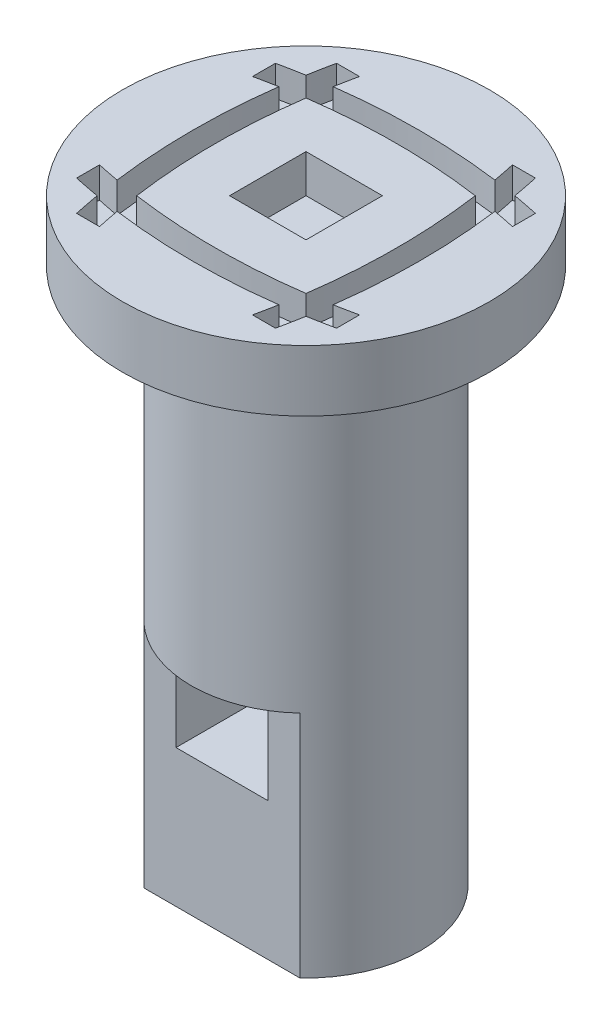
ISO-10303-21;
HEADER;
FILE_DESCRIPTION(('STEP AP214'),'2;1');
FILE_NAME('part.step','',(''),(''),'','','');
FILE_SCHEMA(('AUTOMOTIVE_DESIGN { 1 0 10303 214 1 1 1 1 }'));
ENDSEC;
DATA;
#1=APPLICATION_CONTEXT('core data for automotive mechanical design processes');
#2=APPLICATION_PROTOCOL_DEFINITION('international standard','automotive_design',2000,#1);
#3=PRODUCT_CONTEXT('',#1,'mechanical');
#4=PRODUCT('Part','Part','',(#3));
#5=PRODUCT_RELATED_PRODUCT_CATEGORY('part','',(#4));
#6=PRODUCT_DEFINITION_FORMATION('','',#4);
#7=PRODUCT_DEFINITION_CONTEXT('part definition',#1,'design');
#8=PRODUCT_DEFINITION('design','',#6,#7);
#9=PRODUCT_DEFINITION_SHAPE('','',#8);
#10=(LENGTH_UNIT() NAMED_UNIT(*) SI_UNIT(.MILLI.,.METRE.));
#11=(NAMED_UNIT(*) PLANE_ANGLE_UNIT() SI_UNIT($,.RADIAN.));
#12=(NAMED_UNIT(*) SI_UNIT($,.STERADIAN.) SOLID_ANGLE_UNIT());
#13=UNCERTAINTY_MEASURE_WITH_UNIT(LENGTH_MEASURE(1.E-05),#10,'distance_accuracy_value','');
#14=(GEOMETRIC_REPRESENTATION_CONTEXT(3) GLOBAL_UNCERTAINTY_ASSIGNED_CONTEXT((#13)) GLOBAL_UNIT_ASSIGNED_CONTEXT((#10,
#11,#12)) REPRESENTATION_CONTEXT('',''));
#15=CARTESIAN_POINT('',(0.,0.,0.));
#16=DIRECTION('',(0.,0.,1.));
#17=DIRECTION('',(1.,0.,0.));
#18=AXIS2_PLACEMENT_3D('',#15,#16,#17);
#19=CARTESIAN_POINT('',(0.,8.,0.));
#20=DIRECTION('',(0.,-1.,0.));
#21=DIRECTION('',(0.,0.,-1.));
#22=AXIS2_PLACEMENT_3D('',#19,#20,#21);
#23=CYLINDRICAL_SURFACE('',#22,24.);
#24=CARTESIAN_POINT('',(0.,8.,0.));
#25=DIRECTION('',(0.,1.,0.));
#26=DIRECTION('',(0.,0.,1.));
#27=AXIS2_PLACEMENT_3D('',#24,#25,#26);
#28=CIRCLE('',#27,24.);
#29=CARTESIAN_POINT('',(0.,8.,24.));
#30=VERTEX_POINT('',#29);
#31=EDGE_CURVE('E42',#30,#30,#28,.T.);
#32=ORIENTED_EDGE('',*,*,#31,.F.);
#33=EDGE_LOOP('',(#32));
#34=FACE_BOUND('',#33,.T.);
#35=CARTESIAN_POINT('',(0.,0.,0.));
#36=DIRECTION('',(0.,1.,0.));
#37=DIRECTION('',(0.,0.,1.));
#38=AXIS2_PLACEMENT_3D('',#35,#36,#37);
#39=CIRCLE('',#38,24.);
#40=CARTESIAN_POINT('',(0.,0.,24.));
#41=VERTEX_POINT('',#40);
#42=EDGE_CURVE('E638',#41,#41,#39,.T.);
#43=ORIENTED_EDGE('',*,*,#42,.T.);
#44=EDGE_LOOP('',(#43));
#45=FACE_BOUND('',#44,.T.);
#46=ADVANCED_FACE('F35',(#34,#45),#23,.T.);
#47=CARTESIAN_POINT('',(0.,8.,0.));
#48=DIRECTION('',(0.,1.,0.));
#49=DIRECTION('',(0.,0.,1.));
#50=AXIS2_PLACEMENT_3D('',#47,#48,#49);
#51=PLANE('',#50);
#52=CARTESIAN_POINT('',(65.1728853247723,8.,6.79180291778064E-13));
#53=DIRECTION('',(0.,1.,0.));
#54=DIRECTION('',(0.,0.,-1.));
#55=AXIS2_PLACEMENT_3D('',#52,#53,#54);
#56=CIRCLE('',#55,80.);
#57=CARTESIAN_POINT('',(-12.9999999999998,8.,-17.0000000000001));
#58=VERTEX_POINT('',#57);
#59=CARTESIAN_POINT('',(-13.6534076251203,8.,-13.6534076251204));
#60=VERTEX_POINT('',#59);
#61=EDGE_CURVE('E49',#58,#60,#56,.T.);
#62=ORIENTED_EDGE('',*,*,#61,.F.);
#63=DIRECTION('',(-1.,0.,0.));
#64=VECTOR('',#63,1.);
#65=CARTESIAN_POINT('',(-9.99999999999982,8.,-17.0000000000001));
#66=LINE('',#65,#64);
#67=CARTESIAN_POINT('',(-9.99999999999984,8.,-17.0000000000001));
#68=VERTEX_POINT('',#67);
#69=EDGE_CURVE('E348',#68,#58,#66,.T.);
#70=ORIENTED_EDGE('',*,*,#69,.F.);
#71=CARTESIAN_POINT('',(67.4051839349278,8.,7.06031825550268E-13));
#72=DIRECTION('',(0.,-1.,0.));
#73=DIRECTION('',(0.,0.,-1.));
#74=AXIS2_PLACEMENT_3D('',#71,#72,#73);
#75=CIRCLE('',#74,79.25);
#76=CARTESIAN_POINT('',(-10.575888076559,8.,-14.1249746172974));
#77=VERTEX_POINT('',#76);
#78=EDGE_CURVE('E506',#77,#68,#75,.T.);
#79=ORIENTED_EDGE('',*,*,#78,.F.);
#80=CARTESIAN_POINT('',(0.,8.,65.1728853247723));
#81=DIRECTION('',(0.,1.,0.));
#82=DIRECTION('',(0.,0.,-1.));
#83=AXIS2_PLACEMENT_3D('',#80,#81,#82);
#84=CIRCLE('',#83,80.);
#85=CARTESIAN_POINT('',(10.5758880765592,8.,-14.1249746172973));
#86=VERTEX_POINT('',#85);
#87=EDGE_CURVE('E503',#86,#77,#84,.T.);
#88=ORIENTED_EDGE('',*,*,#87,.F.);
#89=CARTESIAN_POINT('',(-67.4051839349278,8.,-2.31874494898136E-13));
#90=DIRECTION('',(0.,-1.,0.));
#91=DIRECTION('',(0.,0.,-1.));
#92=AXIS2_PLACEMENT_3D('',#89,#90,#91);
#93=CIRCLE('',#92,79.25);
#94=CARTESIAN_POINT('',(10.0000000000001,8.,-17.));
#95=VERTEX_POINT('',#94);
#96=EDGE_CURVE('E500',#95,#86,#93,.T.);
#97=ORIENTED_EDGE('',*,*,#96,.F.);
#98=DIRECTION('',(-1.,0.,0.));
#99=VECTOR('',#98,1.);
#100=CARTESIAN_POINT('',(10.0000000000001,8.,-17.));
#101=LINE('',#100,#99);
#102=CARTESIAN_POINT('',(13.0000000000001,8.,-17.));
#103=VERTEX_POINT('',#102);
#104=EDGE_CURVE('E497',#103,#95,#101,.T.);
#105=ORIENTED_EDGE('',*,*,#104,.F.);
#106=CARTESIAN_POINT('',(-65.1728853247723,8.,-2.20611019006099E-13));
#107=DIRECTION('',(0.,1.,0.));
#108=DIRECTION('',(0.,0.,-1.));
#109=AXIS2_PLACEMENT_3D('',#106,#107,#108);
#110=CIRCLE('',#109,80.);
#111=CARTESIAN_POINT('',(13.6534076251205,8.,-13.6534076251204));
#112=VERTEX_POINT('',#111);
#113=EDGE_CURVE('E494',#112,#103,#110,.T.);
#114=ORIENTED_EDGE('',*,*,#113,.F.);
#115=CARTESIAN_POINT('',(0.,8.,65.1728853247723));
#116=DIRECTION('',(0.,1.,0.));
#117=DIRECTION('',(0.,0.,-1.));
#118=AXIS2_PLACEMENT_3D('',#115,#116,#117);
#119=CIRCLE('',#118,80.);
#120=CARTESIAN_POINT('',(17.,8.,-13.));
#121=VERTEX_POINT('',#120);
#122=EDGE_CURVE('E491',#121,#112,#119,.T.);
#123=ORIENTED_EDGE('',*,*,#122,.F.);
#124=DIRECTION('',(0.,0.,-1.));
#125=VECTOR('',#124,1.);
#126=CARTESIAN_POINT('',(17.,8.,-10.));
#127=LINE('',#126,#125);
#128=CARTESIAN_POINT('',(17.,8.,-9.99999999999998));
#129=VERTEX_POINT('',#128);
#130=EDGE_CURVE('E488',#129,#121,#127,.T.);
#131=ORIENTED_EDGE('',*,*,#130,.F.);
#132=CARTESIAN_POINT('',(0.,8.,67.4051839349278));
#133=DIRECTION('',(0.,-1.,0.));
#134=DIRECTION('',(0.,0.,-1.));
#135=AXIS2_PLACEMENT_3D('',#132,#133,#134);
#136=CIRCLE('',#135,79.25);
#137=CARTESIAN_POINT('',(14.1249746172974,8.,-10.5758880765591));
#138=VERTEX_POINT('',#137);
#139=EDGE_CURVE('E485',#138,#129,#136,.T.);
#140=ORIENTED_EDGE('',*,*,#139,.F.);
#141=CARTESIAN_POINT('',(-65.1728853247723,8.,-2.20611019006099E-13));
#142=DIRECTION('',(0.,1.,0.));
#143=DIRECTION('',(0.,0.,-1.));
#144=AXIS2_PLACEMENT_3D('',#141,#142,#143);
#145=CIRCLE('',#144,80.);
#146=CARTESIAN_POINT('',(14.1249746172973,8.,10.5758880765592));
#147=VERTEX_POINT('',#146);
#148=EDGE_CURVE('E482',#147,#138,#145,.T.);
#149=ORIENTED_EDGE('',*,*,#148,.F.);
#150=CARTESIAN_POINT('',(4.70687883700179E-13,8.,-67.4051839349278));
#151=DIRECTION('',(0.,-1.,0.));
#152=DIRECTION('',(0.,0.,-1.));
#153=AXIS2_PLACEMENT_3D('',#150,#151,#152);
#154=CIRCLE('',#153,79.25);
#155=CARTESIAN_POINT('',(16.9999999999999,8.,10.0000000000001));
#156=VERTEX_POINT('',#155);
#157=EDGE_CURVE('E479',#156,#147,#154,.T.);
#158=ORIENTED_EDGE('',*,*,#157,.F.);
#159=DIRECTION('',(0.,0.,-1.));
#160=VECTOR('',#159,1.);
#161=CARTESIAN_POINT('',(16.9999999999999,8.,10.0000000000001));
#162=LINE('',#161,#160);
#163=CARTESIAN_POINT('',(16.9999999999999,8.,13.0000000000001));
#164=VERTEX_POINT('',#163);
#165=EDGE_CURVE('E476',#164,#156,#162,.T.);
#166=ORIENTED_EDGE('',*,*,#165,.F.);
#167=CARTESIAN_POINT('',(4.51630378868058E-13,8.,-65.1728853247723));
#168=DIRECTION('',(0.,1.,0.));
#169=DIRECTION('',(0.,0.,-1.));
#170=AXIS2_PLACEMENT_3D('',#167,#168,#169);
#171=CIRCLE('',#170,80.);
#172=CARTESIAN_POINT('',(13.6534076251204,8.,13.6534076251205));
#173=VERTEX_POINT('',#172);
#174=EDGE_CURVE('E473',#173,#164,#171,.T.);
#175=ORIENTED_EDGE('',*,*,#174,.F.);
#176=CARTESIAN_POINT('',(-65.1728853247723,8.,-2.20611019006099E-13));
#177=DIRECTION('',(0.,1.,0.));
#178=DIRECTION('',(0.,0.,-1.));
#179=AXIS2_PLACEMENT_3D('',#176,#177,#178);
#180=CIRCLE('',#179,80.);
#181=CARTESIAN_POINT('',(12.9999999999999,8.,17.0000000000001));
#182=VERTEX_POINT('',#181);
#183=EDGE_CURVE('E470',#182,#173,#180,.T.);
#184=ORIENTED_EDGE('',*,*,#183,.F.);
#185=DIRECTION('',(1.,0.,0.));
#186=VECTOR('',#185,1.);
#187=CARTESIAN_POINT('',(9.99999999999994,8.,17.));
#188=LINE('',#187,#186);
#189=CARTESIAN_POINT('',(9.99999999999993,8.,17.));
#190=VERTEX_POINT('',#189);
#191=EDGE_CURVE('E467',#190,#182,#188,.T.);
#192=ORIENTED_EDGE('',*,*,#191,.F.);
#193=CARTESIAN_POINT('',(-67.4051839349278,8.,-2.31874494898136E-13));
#194=DIRECTION('',(0.,-1.,0.));
#195=DIRECTION('',(0.,0.,-1.));
#196=AXIS2_PLACEMENT_3D('',#193,#194,#195);
#197=CIRCLE('',#196,79.25);
#198=CARTESIAN_POINT('',(10.575888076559,8.,14.1249746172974));
#199=VERTEX_POINT('',#198);
#200=EDGE_CURVE('E464',#199,#190,#197,.T.);
#201=ORIENTED_EDGE('',*,*,#200,.F.);
#202=CARTESIAN_POINT('',(4.51630378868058E-13,8.,-65.1728853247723));
#203=DIRECTION('',(0.,1.,0.));
#204=DIRECTION('',(0.,0.,-1.));
#205=AXIS2_PLACEMENT_3D('',#202,#203,#204);
#206=CIRCLE('',#205,80.);
#207=CARTESIAN_POINT('',(-10.5758880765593,8.,14.1249746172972));
#208=VERTEX_POINT('',#207);
#209=EDGE_CURVE('E461',#208,#199,#206,.T.);
#210=ORIENTED_EDGE('',*,*,#209,.F.);
#211=CARTESIAN_POINT('',(67.4051839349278,8.,7.06031825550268E-13));
#212=DIRECTION('',(0.,-1.,0.));
#213=DIRECTION('',(0.,0.,-1.));
#214=AXIS2_PLACEMENT_3D('',#211,#212,#213);
#215=CIRCLE('',#214,79.25);
#216=CARTESIAN_POINT('',(-10.0000000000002,8.,16.9999999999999));
#217=VERTEX_POINT('',#216);
#218=EDGE_CURVE('E458',#217,#208,#215,.T.);
#219=ORIENTED_EDGE('',*,*,#218,.F.);
#220=DIRECTION('',(1.,0.,0.));
#221=VECTOR('',#220,1.);
#222=CARTESIAN_POINT('',(-10.0000000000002,8.,16.9999999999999));
#223=LINE('',#222,#221);
#224=CARTESIAN_POINT('',(-13.0000000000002,8.,16.9999999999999));
#225=VERTEX_POINT('',#224);
#226=EDGE_CURVE('E455',#225,#217,#223,.T.);
#227=ORIENTED_EDGE('',*,*,#226,.F.);
#228=CARTESIAN_POINT('',(65.1728853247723,8.,6.79180291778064E-13));
#229=DIRECTION('',(0.,1.,0.));
#230=DIRECTION('',(0.,0.,-1.));
#231=AXIS2_PLACEMENT_3D('',#228,#229,#230);
#232=CIRCLE('',#231,80.);
#233=CARTESIAN_POINT('',(-13.6534076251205,8.,13.6534076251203));
#234=VERTEX_POINT('',#233);
#235=EDGE_CURVE('E452',#234,#225,#232,.T.);
#236=ORIENTED_EDGE('',*,*,#235,.F.);
#237=CARTESIAN_POINT('',(4.51630378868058E-13,8.,-65.1728853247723));
#238=DIRECTION('',(0.,1.,0.));
#239=DIRECTION('',(0.,0.,-1.));
#240=AXIS2_PLACEMENT_3D('',#237,#238,#239);
#241=CIRCLE('',#240,80.);
#242=CARTESIAN_POINT('',(-17.0000000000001,8.,12.9999999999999));
#243=VERTEX_POINT('',#242);
#244=EDGE_CURVE('E449',#243,#234,#241,.T.);
#245=ORIENTED_EDGE('',*,*,#244,.F.);
#246=DIRECTION('',(0.,0.,1.));
#247=VECTOR('',#246,1.);
#248=CARTESIAN_POINT('',(-17.0000000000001,8.,9.99999999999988));
#249=LINE('',#248,#247);
#250=CARTESIAN_POINT('',(-17.,8.,9.99999999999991));
#251=VERTEX_POINT('',#250);
#252=EDGE_CURVE('E446',#251,#243,#249,.T.);
#253=ORIENTED_EDGE('',*,*,#252,.F.);
#254=CARTESIAN_POINT('',(4.70687883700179E-13,8.,-67.4051839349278));
#255=DIRECTION('',(0.,-1.,0.));
#256=DIRECTION('',(0.,0.,-1.));
#257=AXIS2_PLACEMENT_3D('',#254,#255,#256);
#258=CIRCLE('',#257,79.25);
#259=CARTESIAN_POINT('',(-14.1249746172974,8.,10.5758880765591));
#260=VERTEX_POINT('',#259);
#261=EDGE_CURVE('E443',#260,#251,#258,.T.);
#262=ORIENTED_EDGE('',*,*,#261,.F.);
#263=CARTESIAN_POINT('',(65.1728853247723,8.,6.79180291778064E-13));
#264=DIRECTION('',(0.,1.,0.));
#265=DIRECTION('',(0.,0.,-1.));
#266=AXIS2_PLACEMENT_3D('',#263,#264,#265);
#267=CIRCLE('',#266,80.);
#268=CARTESIAN_POINT('',(-14.1249746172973,8.,-10.5758880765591));
#269=VERTEX_POINT('',#268);
#270=EDGE_CURVE('E440',#269,#260,#267,.T.);
#271=ORIENTED_EDGE('',*,*,#270,.F.);
#272=CARTESIAN_POINT('',(0.,8.,67.4051839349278));
#273=DIRECTION('',(0.,-1.,0.));
#274=DIRECTION('',(0.,0.,-1.));
#275=AXIS2_PLACEMENT_3D('',#272,#273,#274);
#276=CIRCLE('',#275,79.25);
#277=CARTESIAN_POINT('',(-17.,8.,-10.));
#278=VERTEX_POINT('',#277);
#279=EDGE_CURVE('E437',#278,#269,#276,.T.);
#280=ORIENTED_EDGE('',*,*,#279,.F.);
#281=DIRECTION('',(0.,0.,1.));
#282=VECTOR('',#281,1.);
#283=CARTESIAN_POINT('',(-17.,8.,-10.));
#284=LINE('',#283,#282);
#285=CARTESIAN_POINT('',(-17.,8.,-13.));
#286=VERTEX_POINT('',#285);
#287=EDGE_CURVE('E434',#286,#278,#284,.T.);
#288=ORIENTED_EDGE('',*,*,#287,.F.);
#289=CARTESIAN_POINT('',(0.,8.,65.1728853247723));
#290=DIRECTION('',(0.,1.,0.));
#291=DIRECTION('',(0.,0.,-1.));
#292=AXIS2_PLACEMENT_3D('',#289,#290,#291);
#293=CIRCLE('',#292,80.);
#294=EDGE_CURVE('E431',#60,#286,#293,.T.);
#295=ORIENTED_EDGE('',*,*,#294,.F.);
#296=EDGE_LOOP('',(#62,#70,#79,#88,#97,#105,#114,#123,#131,#140,#149,#158,#166,#175,#184,#192,
#201,#210,#219,#227,#236,#245,#253,#262,#271,#280,#288,#295));
#297=FACE_BOUND('',#296,.T.);
#298=ORIENTED_EDGE('',*,*,#31,.T.);
#299=EDGE_LOOP('',(#298));
#300=FACE_BOUND('',#299,.T.);
#301=ADVANCED_FACE('F653',(#297,#300),#51,.T.);
#302=CARTESIAN_POINT('',(0.,0.,0.));
#303=DIRECTION('',(0.,1.,0.));
#304=DIRECTION('',(0.,0.,1.));
#305=AXIS2_PLACEMENT_3D('',#302,#303,#304);
#306=PLANE('',#305);
#307=CARTESIAN_POINT('',(0.,0.,0.));
#308=DIRECTION('',(0.,1.,0.));
#309=DIRECTION('',(0.,0.,1.));
#310=AXIS2_PLACEMENT_3D('',#307,#308,#309);
#311=CIRCLE('',#310,15.);
#312=CARTESIAN_POINT('',(0.,0.,15.));
#313=VERTEX_POINT('',#312);
#314=EDGE_CURVE('E11',#313,#313,#311,.F.);
#315=ORIENTED_EDGE('',*,*,#314,.F.);
#316=EDGE_LOOP('',(#315));
#317=FACE_BOUND('',#316,.T.);
#318=ORIENTED_EDGE('',*,*,#42,.F.);
#319=EDGE_LOOP('',(#318));
#320=FACE_BOUND('',#319,.T.);
#321=ADVANCED_FACE('F650',(#317,#320),#306,.F.);
#322=CARTESIAN_POINT('',(0.,-70.,0.));
#323=DIRECTION('',(0.,1.,0.));
#324=DIRECTION('',(0.,0.,1.));
#325=AXIS2_PLACEMENT_3D('',#322,#323,#324);
#326=CYLINDRICAL_SURFACE('',#325,15.);
#327=CARTESIAN_POINT('',(0.,-70.,0.));
#328=DIRECTION('',(0.,-1.,0.));
#329=DIRECTION('',(0.,0.,-1.));
#330=AXIS2_PLACEMENT_3D('',#327,#328,#329);
#331=CIRCLE('',#330,15.);
#332=CARTESIAN_POINT('',(-10.1980390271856,-70.,11.));
#333=VERTEX_POINT('',#332);
#334=CARTESIAN_POINT('',(10.1980390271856,-70.,11.));
#335=VERTEX_POINT('',#334);
#336=EDGE_CURVE('E607',#333,#335,#331,.T.);
#337=ORIENTED_EDGE('',*,*,#336,.F.);
#338=DIRECTION('',(0.,-1.,0.));
#339=VECTOR('',#338,1.);
#340=CARTESIAN_POINT('',(-10.1980390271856,-40.,11.));
#341=LINE('',#340,#339);
#342=CARTESIAN_POINT('',(-10.1980390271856,-40.,11.));
#343=VERTEX_POINT('',#342);
#344=EDGE_CURVE('E605',#343,#333,#341,.T.);
#345=ORIENTED_EDGE('',*,*,#344,.F.);
#346=CARTESIAN_POINT('',(0.,-40.,0.));
#347=DIRECTION('',(0.,-1.,0.));
#348=DIRECTION('',(0.,0.,-1.));
#349=AXIS2_PLACEMENT_3D('',#346,#347,#348);
#350=CIRCLE('',#349,15.);
#351=CARTESIAN_POINT('',(10.1980390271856,-40.,11.));
#352=VERTEX_POINT('',#351);
#353=EDGE_CURVE('E599',#352,#343,#350,.T.);
#354=ORIENTED_EDGE('',*,*,#353,.F.);
#355=DIRECTION('',(0.,-1.,0.));
#356=VECTOR('',#355,1.);
#357=CARTESIAN_POINT('',(10.1980390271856,-40.,11.));
#358=LINE('',#357,#356);
#359=EDGE_CURVE('E603',#352,#335,#358,.T.);
#360=ORIENTED_EDGE('',*,*,#359,.T.);
#361=EDGE_LOOP('',(#337,#345,#354,#360));
#362=FACE_BOUND('',#361,.T.);
#363=ORIENTED_EDGE('',*,*,#314,.T.);
#364=EDGE_LOOP('',(#363));
#365=FACE_BOUND('',#364,.T.);
#366=ADVANCED_FACE('F652',(#362,#365),#326,.T.);
#367=CARTESIAN_POINT('',(0.,-70.,0.));
#368=DIRECTION('',(0.,-1.,0.));
#369=DIRECTION('',(0.,0.,-1.));
#370=AXIS2_PLACEMENT_3D('',#367,#368,#369);
#371=PLANE('',#370);
#372=DIRECTION('',(1.,0.,0.));
#373=VECTOR('',#372,1.);
#374=CARTESIAN_POINT('',(-10.1980390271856,-70.,11.));
#375=LINE('',#374,#373);
#376=EDGE_CURVE('E590',#333,#335,#375,.T.);
#377=ORIENTED_EDGE('',*,*,#376,.F.);
#378=ORIENTED_EDGE('',*,*,#336,.T.);
#379=EDGE_LOOP('',(#377,#378));
#380=FACE_BOUND('',#379,.T.);
#381=ADVANCED_FACE('F659',(#380),#371,.T.);
#382=CARTESIAN_POINT('',(-10.1980390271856,-40.,11.));
#383=DIRECTION('',(0.,0.,-1.));
#384=DIRECTION('',(-1.,0.,0.));
#385=AXIS2_PLACEMENT_3D('',#382,#383,#384);
#386=PLANE('',#385);
#387=DIRECTION('',(1.,0.,0.));
#388=VECTOR('',#387,1.);
#389=CARTESIAN_POINT('',(-10.1980390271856,-40.,11.));
#390=LINE('',#389,#388);
#391=CARTESIAN_POINT('',(6.,-40.,11.));
#392=VERTEX_POINT('',#391);
#393=EDGE_CURVE('E600',#392,#352,#390,.T.);
#394=ORIENTED_EDGE('',*,*,#393,.F.);
#395=DIRECTION('',(0.,1.,0.));
#396=VECTOR('',#395,1.);
#397=CARTESIAN_POINT('',(6.00000000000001,-52.,11.));
#398=LINE('',#397,#396);
#399=CARTESIAN_POINT('',(6.00000000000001,-52.,11.));
#400=VERTEX_POINT('',#399);
#401=EDGE_CURVE('E571',#400,#392,#398,.T.);
#402=ORIENTED_EDGE('',*,*,#401,.F.);
#403=DIRECTION('',(1.,0.,0.));
#404=VECTOR('',#403,1.);
#405=CARTESIAN_POINT('',(-5.99999999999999,-52.,11.));
#406=LINE('',#405,#404);
#407=CARTESIAN_POINT('',(-5.99999999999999,-52.,11.));
#408=VERTEX_POINT('',#407);
#409=EDGE_CURVE('E583',#408,#400,#406,.T.);
#410=ORIENTED_EDGE('',*,*,#409,.F.);
#411=DIRECTION('',(0.,-1.,0.));
#412=VECTOR('',#411,1.);
#413=CARTESIAN_POINT('',(-6.,-40.,11.));
#414=LINE('',#413,#412);
#415=CARTESIAN_POINT('',(-6.,-40.,11.));
#416=VERTEX_POINT('',#415);
#417=EDGE_CURVE('E513',#416,#408,#414,.T.);
#418=ORIENTED_EDGE('',*,*,#417,.F.);
#419=EDGE_CURVE('E596',#343,#416,#390,.T.);
#420=ORIENTED_EDGE('',*,*,#419,.F.);
#421=ORIENTED_EDGE('',*,*,#344,.T.);
#422=ORIENTED_EDGE('',*,*,#376,.T.);
#423=ORIENTED_EDGE('',*,*,#359,.F.);
#424=EDGE_LOOP('',(#394,#402,#410,#418,#420,#421,#422,#423));
#425=FACE_BOUND('',#424,.T.);
#426=ADVANCED_FACE('F1073',(#425),#386,.F.);
#427=CARTESIAN_POINT('',(0.,-40.,0.));
#428=DIRECTION('',(0.,-1.,0.));
#429=DIRECTION('',(0.,0.,-1.));
#430=AXIS2_PLACEMENT_3D('',#427,#428,#429);
#431=PLANE('',#430);
#432=ORIENTED_EDGE('',*,*,#419,.T.);
#433=DIRECTION('',(0.,0.,1.));
#434=VECTOR('',#433,1.);
#435=CARTESIAN_POINT('',(-6.,-40.,-1.));
#436=LINE('',#435,#434);
#437=CARTESIAN_POINT('',(-6.,-40.,-1.));
#438=VERTEX_POINT('',#437);
#439=EDGE_CURVE('E580',#438,#416,#436,.T.);
#440=ORIENTED_EDGE('',*,*,#439,.F.);
#441=DIRECTION('',(-1.,0.,0.));
#442=VECTOR('',#441,1.);
#443=CARTESIAN_POINT('',(6.,-40.,-1.));
#444=LINE('',#443,#442);
#445=CARTESIAN_POINT('',(6.,-40.,-1.));
#446=VERTEX_POINT('',#445);
#447=EDGE_CURVE('E567',#446,#438,#444,.T.);
#448=ORIENTED_EDGE('',*,*,#447,.F.);
#449=DIRECTION('',(0.,0.,1.));
#450=VECTOR('',#449,1.);
#451=CARTESIAN_POINT('',(6.,-40.,-1.));
#452=LINE('',#451,#450);
#453=EDGE_CURVE('E587',#446,#392,#452,.T.);
#454=ORIENTED_EDGE('',*,*,#453,.T.);
#455=ORIENTED_EDGE('',*,*,#393,.T.);
#456=ORIENTED_EDGE('',*,*,#353,.T.);
#457=EDGE_LOOP('',(#432,#440,#448,#454,#455,#456));
#458=FACE_BOUND('',#457,.T.);
#459=ADVANCED_FACE('F1083',(#458),#431,.T.);
#460=CARTESIAN_POINT('',(6.00000000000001,-52.,-1.));
#461=DIRECTION('',(1.,0.,0.));
#462=DIRECTION('',(0.,1.,0.));
#463=AXIS2_PLACEMENT_3D('',#460,#461,#462);
#464=PLANE('',#463);
#465=ORIENTED_EDGE('',*,*,#401,.T.);
#466=ORIENTED_EDGE('',*,*,#453,.F.);
#467=DIRECTION('',(0.,1.,0.));
#468=VECTOR('',#467,1.);
#469=CARTESIAN_POINT('',(6.00000000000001,-52.,-1.));
#470=LINE('',#469,#468);
#471=CARTESIAN_POINT('',(6.00000000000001,-52.,-1.));
#472=VERTEX_POINT('',#471);
#473=EDGE_CURVE('E577',#472,#446,#470,.T.);
#474=ORIENTED_EDGE('',*,*,#473,.F.);
#475=DIRECTION('',(0.,0.,1.));
#476=VECTOR('',#475,1.);
#477=CARTESIAN_POINT('',(6.00000000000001,-52.,-1.));
#478=LINE('',#477,#476);
#479=EDGE_CURVE('E591',#472,#400,#478,.T.);
#480=ORIENTED_EDGE('',*,*,#479,.T.);
#481=EDGE_LOOP('',(#465,#466,#474,#480));
#482=FACE_BOUND('',#481,.T.);
#483=ADVANCED_FACE('F1094',(#482),#464,.F.);
#484=CARTESIAN_POINT('',(-5.99999999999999,-52.,-1.));
#485=DIRECTION('',(0.,-1.,0.));
#486=DIRECTION('',(0.,0.,-1.));
#487=AXIS2_PLACEMENT_3D('',#484,#485,#486);
#488=PLANE('',#487);
#489=ORIENTED_EDGE('',*,*,#409,.T.);
#490=ORIENTED_EDGE('',*,*,#479,.F.);
#491=DIRECTION('',(1.,0.,0.));
#492=VECTOR('',#491,1.);
#493=CARTESIAN_POINT('',(-5.99999999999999,-52.,-1.));
#494=LINE('',#493,#492);
#495=CARTESIAN_POINT('',(-5.99999999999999,-52.,-1.));
#496=VERTEX_POINT('',#495);
#497=EDGE_CURVE('E574',#496,#472,#494,.T.);
#498=ORIENTED_EDGE('',*,*,#497,.F.);
#499=DIRECTION('',(0.,0.,1.));
#500=VECTOR('',#499,1.);
#501=CARTESIAN_POINT('',(-5.99999999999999,-52.,-1.));
#502=LINE('',#501,#500);
#503=EDGE_CURVE('E593',#496,#408,#502,.T.);
#504=ORIENTED_EDGE('',*,*,#503,.T.);
#505=EDGE_LOOP('',(#489,#490,#498,#504));
#506=FACE_BOUND('',#505,.T.);
#507=ADVANCED_FACE('F1104',(#506),#488,.F.);
#508=CARTESIAN_POINT('',(-6.,-40.,-1.));
#509=DIRECTION('',(-1.,0.,0.));
#510=DIRECTION('',(0.,-1.,0.));
#511=AXIS2_PLACEMENT_3D('',#508,#509,#510);
#512=PLANE('',#511);
#513=ORIENTED_EDGE('',*,*,#417,.T.);
#514=ORIENTED_EDGE('',*,*,#503,.F.);
#515=DIRECTION('',(0.,-1.,0.));
#516=VECTOR('',#515,1.);
#517=CARTESIAN_POINT('',(-6.,-40.,-1.));
#518=LINE('',#517,#516);
#519=EDGE_CURVE('E570',#438,#496,#518,.T.);
#520=ORIENTED_EDGE('',*,*,#519,.F.);
#521=ORIENTED_EDGE('',*,*,#439,.T.);
#522=EDGE_LOOP('',(#513,#514,#520,#521));
#523=FACE_BOUND('',#522,.T.);
#524=ADVANCED_FACE('F1113',(#523),#512,.F.);
#525=CARTESIAN_POINT('',(0.,0.,-1.));
#526=DIRECTION('',(0.,0.,1.));
#527=DIRECTION('',(1.,0.,0.));
#528=AXIS2_PLACEMENT_3D('',#525,#526,#527);
#529=PLANE('',#528);
#530=ORIENTED_EDGE('',*,*,#447,.T.);
#531=ORIENTED_EDGE('',*,*,#519,.T.);
#532=ORIENTED_EDGE('',*,*,#497,.T.);
#533=ORIENTED_EDGE('',*,*,#473,.T.);
#534=EDGE_LOOP('',(#530,#531,#532,#533));
#535=FACE_BOUND('',#534,.T.);
#536=ADVANCED_FACE('F684',(#535),#529,.T.);
#537=CARTESIAN_POINT('',(65.1728853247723,4.,6.79180291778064E-13));
#538=DIRECTION('',(0.,1.,0.));
#539=DIRECTION('',(0.,0.,1.));
#540=AXIS2_PLACEMENT_3D('',#537,#538,#539);
#541=CYLINDRICAL_SURFACE('',#540,80.);
#542=ORIENTED_EDGE('',*,*,#61,.T.);
#543=DIRECTION('',(0.,1.,0.));
#544=VECTOR('',#543,1.);
#545=CARTESIAN_POINT('',(-13.6534076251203,4.,-13.6534076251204));
#546=LINE('',#545,#544);
#547=CARTESIAN_POINT('',(-13.6534076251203,4.,-13.6534076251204));
#548=VERTEX_POINT('',#547);
#549=EDGE_CURVE('E429',#548,#60,#546,.T.);
#550=ORIENTED_EDGE('',*,*,#549,.F.);
#551=CARTESIAN_POINT('',(65.1728853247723,4.,6.79180291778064E-13));
#552=DIRECTION('',(0.,1.,0.));
#553=DIRECTION('',(0.,0.,-1.));
#554=AXIS2_PLACEMENT_3D('',#551,#552,#553);
#555=CIRCLE('',#554,80.);
#556=CARTESIAN_POINT('',(-12.9999999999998,4.,-17.0000000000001));
#557=VERTEX_POINT('',#556);
#558=EDGE_CURVE('E344',#557,#548,#555,.T.);
#559=ORIENTED_EDGE('',*,*,#558,.F.);
#560=DIRECTION('',(0.,1.,0.));
#561=VECTOR('',#560,1.);
#562=CARTESIAN_POINT('',(-12.9999999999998,4.,-17.0000000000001));
#563=LINE('',#562,#561);
#564=EDGE_CURVE('E511',#557,#58,#563,.T.);
#565=ORIENTED_EDGE('',*,*,#564,.T.);
#566=EDGE_LOOP('',(#542,#550,#559,#565));
#567=FACE_BOUND('',#566,.T.);
#568=ADVANCED_FACE('F689',(#567),#541,.F.);
#569=CARTESIAN_POINT('',(-9.99999999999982,4.,-17.0000000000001));
#570=DIRECTION('',(0.,0.,-1.));
#571=DIRECTION('',(-1.,0.,0.));
#572=AXIS2_PLACEMENT_3D('',#569,#570,#571);
#573=PLANE('',#572);
#574=ORIENTED_EDGE('',*,*,#69,.T.);
#575=ORIENTED_EDGE('',*,*,#564,.F.);
#576=DIRECTION('',(-1.,0.,0.));
#577=VECTOR('',#576,1.);
#578=CARTESIAN_POINT('',(-9.99999999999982,4.,-17.0000000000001));
#579=LINE('',#578,#577);
#580=CARTESIAN_POINT('',(-9.99999999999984,4.,-17.0000000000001));
#581=VERTEX_POINT('',#580);
#582=EDGE_CURVE('E426',#581,#557,#579,.T.);
#583=ORIENTED_EDGE('',*,*,#582,.F.);
#584=DIRECTION('',(0.,1.,0.));
#585=VECTOR('',#584,1.);
#586=CARTESIAN_POINT('',(-9.99999999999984,4.,-17.0000000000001));
#587=LINE('',#586,#585);
#588=EDGE_CURVE('E514',#581,#68,#587,.T.);
#589=ORIENTED_EDGE('',*,*,#588,.T.);
#590=EDGE_LOOP('',(#574,#575,#583,#589));
#591=FACE_BOUND('',#590,.T.);
#592=ADVANCED_FACE('F694',(#591),#573,.F.);
#593=CARTESIAN_POINT('',(67.4051839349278,4.,7.06031825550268E-13));
#594=DIRECTION('',(0.,1.,0.));
#595=DIRECTION('',(0.,0.,1.));
#596=AXIS2_PLACEMENT_3D('',#593,#594,#595);
#597=CYLINDRICAL_SURFACE('',#596,79.25);
#598=ORIENTED_EDGE('',*,*,#78,.T.);
#599=ORIENTED_EDGE('',*,*,#588,.F.);
#600=CARTESIAN_POINT('',(67.4051839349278,4.,7.06031825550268E-13));
#601=DIRECTION('',(0.,-1.,0.));
#602=DIRECTION('',(0.,0.,-1.));
#603=AXIS2_PLACEMENT_3D('',#600,#601,#602);
#604=CIRCLE('',#603,79.25);
#605=CARTESIAN_POINT('',(-10.575888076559,4.,-14.1249746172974));
#606=VERTEX_POINT('',#605);
#607=EDGE_CURVE('E423',#606,#581,#604,.T.);
#608=ORIENTED_EDGE('',*,*,#607,.F.);
#609=DIRECTION('',(0.,1.,0.));
#610=VECTOR('',#609,1.);
#611=CARTESIAN_POINT('',(-10.575888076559,4.,-14.1249746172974));
#612=LINE('',#611,#610);
#613=EDGE_CURVE('E516',#606,#77,#612,.T.);
#614=ORIENTED_EDGE('',*,*,#613,.T.);
#615=EDGE_LOOP('',(#598,#599,#608,#614));
#616=FACE_BOUND('',#615,.T.);
#617=ADVANCED_FACE('F704',(#616),#597,.T.);
#618=CARTESIAN_POINT('',(0.,4.,65.1728853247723));
#619=DIRECTION('',(0.,1.,0.));
#620=DIRECTION('',(0.,0.,1.));
#621=AXIS2_PLACEMENT_3D('',#618,#619,#620);
#622=CYLINDRICAL_SURFACE('',#621,80.);
#623=ORIENTED_EDGE('',*,*,#87,.T.);
#624=ORIENTED_EDGE('',*,*,#613,.F.);
#625=CARTESIAN_POINT('',(0.,4.,65.1728853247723));
#626=DIRECTION('',(0.,1.,0.));
#627=DIRECTION('',(0.,0.,-1.));
#628=AXIS2_PLACEMENT_3D('',#625,#626,#627);
#629=CIRCLE('',#628,80.);
#630=CARTESIAN_POINT('',(10.5758880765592,4.,-14.1249746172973));
#631=VERTEX_POINT('',#630);
#632=EDGE_CURVE('E420',#631,#606,#629,.T.);
#633=ORIENTED_EDGE('',*,*,#632,.F.);
#634=DIRECTION('',(0.,1.,0.));
#635=VECTOR('',#634,1.);
#636=CARTESIAN_POINT('',(10.5758880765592,4.,-14.1249746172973));
#637=LINE('',#636,#635);
#638=EDGE_CURVE('E518',#631,#86,#637,.T.);
#639=ORIENTED_EDGE('',*,*,#638,.T.);
#640=EDGE_LOOP('',(#623,#624,#633,#639));
#641=FACE_BOUND('',#640,.T.);
#642=ADVANCED_FACE('F714',(#641),#622,.F.);
#643=CARTESIAN_POINT('',(-67.4051839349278,4.,-2.31874494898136E-13));
#644=DIRECTION('',(0.,1.,0.));
#645=DIRECTION('',(0.,0.,1.));
#646=AXIS2_PLACEMENT_3D('',#643,#644,#645);
#647=CYLINDRICAL_SURFACE('',#646,79.25);
#648=ORIENTED_EDGE('',*,*,#96,.T.);
#649=ORIENTED_EDGE('',*,*,#638,.F.);
#650=CARTESIAN_POINT('',(-67.4051839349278,4.,-2.31874494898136E-13));
#651=DIRECTION('',(0.,-1.,0.));
#652=DIRECTION('',(0.,0.,-1.));
#653=AXIS2_PLACEMENT_3D('',#650,#651,#652);
#654=CIRCLE('',#653,79.25);
#655=CARTESIAN_POINT('',(10.0000000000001,4.,-17.));
#656=VERTEX_POINT('',#655);
#657=EDGE_CURVE('E417',#656,#631,#654,.T.);
#658=ORIENTED_EDGE('',*,*,#657,.F.);
#659=DIRECTION('',(0.,1.,0.));
#660=VECTOR('',#659,1.);
#661=CARTESIAN_POINT('',(10.0000000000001,4.,-17.));
#662=LINE('',#661,#660);
#663=EDGE_CURVE('E520',#656,#95,#662,.T.);
#664=ORIENTED_EDGE('',*,*,#663,.T.);
#665=EDGE_LOOP('',(#648,#649,#658,#664));
#666=FACE_BOUND('',#665,.T.);
#667=ADVANCED_FACE('F724',(#666),#647,.T.);
#668=CARTESIAN_POINT('',(10.0000000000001,4.,-17.));
#669=DIRECTION('',(0.,0.,-1.));
#670=DIRECTION('',(-1.,0.,0.));
#671=AXIS2_PLACEMENT_3D('',#668,#669,#670);
#672=PLANE('',#671);
#673=ORIENTED_EDGE('',*,*,#104,.T.);
#674=ORIENTED_EDGE('',*,*,#663,.F.);
#675=DIRECTION('',(-1.,0.,0.));
#676=VECTOR('',#675,1.);
#677=CARTESIAN_POINT('',(10.0000000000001,4.,-17.));
#678=LINE('',#677,#676);
#679=CARTESIAN_POINT('',(13.0000000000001,4.,-17.));
#680=VERTEX_POINT('',#679);
#681=EDGE_CURVE('E414',#680,#656,#678,.T.);
#682=ORIENTED_EDGE('',*,*,#681,.F.);
#683=DIRECTION('',(0.,1.,0.));
#684=VECTOR('',#683,1.);
#685=CARTESIAN_POINT('',(13.0000000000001,4.,-17.));
#686=LINE('',#685,#684);
#687=EDGE_CURVE('E522',#680,#103,#686,.T.);
#688=ORIENTED_EDGE('',*,*,#687,.T.);
#689=EDGE_LOOP('',(#673,#674,#682,#688));
#690=FACE_BOUND('',#689,.T.);
#691=ADVANCED_FACE('F734',(#690),#672,.F.);
#692=CARTESIAN_POINT('',(-65.1728853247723,4.,-2.20611019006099E-13));
#693=DIRECTION('',(0.,1.,0.));
#694=DIRECTION('',(0.,0.,1.));
#695=AXIS2_PLACEMENT_3D('',#692,#693,#694);
#696=CYLINDRICAL_SURFACE('',#695,80.);
#697=ORIENTED_EDGE('',*,*,#113,.T.);
#698=ORIENTED_EDGE('',*,*,#687,.F.);
#699=CARTESIAN_POINT('',(-65.1728853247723,4.,-2.20611019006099E-13));
#700=DIRECTION('',(0.,1.,0.));
#701=DIRECTION('',(0.,0.,-1.));
#702=AXIS2_PLACEMENT_3D('',#699,#700,#701);
#703=CIRCLE('',#702,80.);
#704=CARTESIAN_POINT('',(13.6534076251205,4.,-13.6534076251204));
#705=VERTEX_POINT('',#704);
#706=EDGE_CURVE('E411',#705,#680,#703,.T.);
#707=ORIENTED_EDGE('',*,*,#706,.F.);
#708=DIRECTION('',(0.,1.,0.));
#709=VECTOR('',#708,1.);
#710=CARTESIAN_POINT('',(13.6534076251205,4.,-13.6534076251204));
#711=LINE('',#710,#709);
#712=EDGE_CURVE('E524',#705,#112,#711,.T.);
#713=ORIENTED_EDGE('',*,*,#712,.T.);
#714=EDGE_LOOP('',(#697,#698,#707,#713));
#715=FACE_BOUND('',#714,.T.);
#716=ADVANCED_FACE('F744',(#715),#696,.F.);
#717=CARTESIAN_POINT('',(0.,4.,65.1728853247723));
#718=DIRECTION('',(0.,1.,0.));
#719=DIRECTION('',(0.,0.,1.));
#720=AXIS2_PLACEMENT_3D('',#717,#718,#719);
#721=CYLINDRICAL_SURFACE('',#720,80.);
#722=ORIENTED_EDGE('',*,*,#122,.T.);
#723=ORIENTED_EDGE('',*,*,#712,.F.);
#724=CARTESIAN_POINT('',(0.,4.,65.1728853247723));
#725=DIRECTION('',(0.,1.,0.));
#726=DIRECTION('',(0.,0.,-1.));
#727=AXIS2_PLACEMENT_3D('',#724,#725,#726);
#728=CIRCLE('',#727,80.);
#729=CARTESIAN_POINT('',(17.,4.,-13.));
#730=VERTEX_POINT('',#729);
#731=EDGE_CURVE('E408',#730,#705,#728,.T.);
#732=ORIENTED_EDGE('',*,*,#731,.F.);
#733=DIRECTION('',(0.,1.,0.));
#734=VECTOR('',#733,1.);
#735=CARTESIAN_POINT('',(17.,4.,-13.));
#736=LINE('',#735,#734);
#737=EDGE_CURVE('E526',#730,#121,#736,.T.);
#738=ORIENTED_EDGE('',*,*,#737,.T.);
#739=EDGE_LOOP('',(#722,#723,#732,#738));
#740=FACE_BOUND('',#739,.T.);
#741=ADVANCED_FACE('F754',(#740),#721,.F.);
#742=CARTESIAN_POINT('',(17.,4.,-10.));
#743=DIRECTION('',(1.,0.,0.));
#744=DIRECTION('',(0.,0.,-1.));
#745=AXIS2_PLACEMENT_3D('',#742,#743,#744);
#746=PLANE('',#745);
#747=ORIENTED_EDGE('',*,*,#130,.T.);
#748=ORIENTED_EDGE('',*,*,#737,.F.);
#749=DIRECTION('',(0.,0.,-1.));
#750=VECTOR('',#749,1.);
#751=CARTESIAN_POINT('',(17.,4.,-10.));
#752=LINE('',#751,#750);
#753=CARTESIAN_POINT('',(17.,4.,-9.99999999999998));
#754=VERTEX_POINT('',#753);
#755=EDGE_CURVE('E405',#754,#730,#752,.T.);
#756=ORIENTED_EDGE('',*,*,#755,.F.);
#757=DIRECTION('',(0.,1.,0.));
#758=VECTOR('',#757,1.);
#759=CARTESIAN_POINT('',(17.,4.,-9.99999999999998));
#760=LINE('',#759,#758);
#761=EDGE_CURVE('E528',#754,#129,#760,.T.);
#762=ORIENTED_EDGE('',*,*,#761,.T.);
#763=EDGE_LOOP('',(#747,#748,#756,#762));
#764=FACE_BOUND('',#763,.T.);
#765=ADVANCED_FACE('F764',(#764),#746,.F.);
#766=CARTESIAN_POINT('',(0.,4.,67.4051839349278));
#767=DIRECTION('',(0.,1.,0.));
#768=DIRECTION('',(0.,0.,1.));
#769=AXIS2_PLACEMENT_3D('',#766,#767,#768);
#770=CYLINDRICAL_SURFACE('',#769,79.25);
#771=ORIENTED_EDGE('',*,*,#139,.T.);
#772=ORIENTED_EDGE('',*,*,#761,.F.);
#773=CARTESIAN_POINT('',(0.,4.,67.4051839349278));
#774=DIRECTION('',(0.,-1.,0.));
#775=DIRECTION('',(0.,0.,-1.));
#776=AXIS2_PLACEMENT_3D('',#773,#774,#775);
#777=CIRCLE('',#776,79.25);
#778=CARTESIAN_POINT('',(14.1249746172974,4.,-10.5758880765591));
#779=VERTEX_POINT('',#778);
#780=EDGE_CURVE('E402',#779,#754,#777,.T.);
#781=ORIENTED_EDGE('',*,*,#780,.F.);
#782=DIRECTION('',(0.,1.,0.));
#783=VECTOR('',#782,1.);
#784=CARTESIAN_POINT('',(14.1249746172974,4.,-10.5758880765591));
#785=LINE('',#784,#783);
#786=EDGE_CURVE('E530',#779,#138,#785,.T.);
#787=ORIENTED_EDGE('',*,*,#786,.T.);
#788=EDGE_LOOP('',(#771,#772,#781,#787));
#789=FACE_BOUND('',#788,.T.);
#790=ADVANCED_FACE('F774',(#789),#770,.T.);
#791=CARTESIAN_POINT('',(-65.1728853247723,4.,-2.20611019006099E-13));
#792=DIRECTION('',(0.,1.,0.));
#793=DIRECTION('',(0.,0.,1.));
#794=AXIS2_PLACEMENT_3D('',#791,#792,#793);
#795=CYLINDRICAL_SURFACE('',#794,80.);
#796=ORIENTED_EDGE('',*,*,#148,.T.);
#797=ORIENTED_EDGE('',*,*,#786,.F.);
#798=CARTESIAN_POINT('',(-65.1728853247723,4.,-2.20611019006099E-13));
#799=DIRECTION('',(0.,1.,0.));
#800=DIRECTION('',(0.,0.,-1.));
#801=AXIS2_PLACEMENT_3D('',#798,#799,#800);
#802=CIRCLE('',#801,80.);
#803=CARTESIAN_POINT('',(14.1249746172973,4.,10.5758880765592));
#804=VERTEX_POINT('',#803);
#805=EDGE_CURVE('E399',#804,#779,#802,.T.);
#806=ORIENTED_EDGE('',*,*,#805,.F.);
#807=DIRECTION('',(0.,1.,0.));
#808=VECTOR('',#807,1.);
#809=CARTESIAN_POINT('',(14.1249746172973,4.,10.5758880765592));
#810=LINE('',#809,#808);
#811=EDGE_CURVE('E532',#804,#147,#810,.T.);
#812=ORIENTED_EDGE('',*,*,#811,.T.);
#813=EDGE_LOOP('',(#796,#797,#806,#812));
#814=FACE_BOUND('',#813,.T.);
#815=ADVANCED_FACE('F784',(#814),#795,.F.);
#816=CARTESIAN_POINT('',(4.70687883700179E-13,4.,-67.4051839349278));
#817=DIRECTION('',(0.,1.,0.));
#818=DIRECTION('',(0.,0.,1.));
#819=AXIS2_PLACEMENT_3D('',#816,#817,#818);
#820=CYLINDRICAL_SURFACE('',#819,79.25);
#821=ORIENTED_EDGE('',*,*,#157,.T.);
#822=ORIENTED_EDGE('',*,*,#811,.F.);
#823=CARTESIAN_POINT('',(4.70687883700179E-13,4.,-67.4051839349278));
#824=DIRECTION('',(0.,-1.,0.));
#825=DIRECTION('',(0.,0.,-1.));
#826=AXIS2_PLACEMENT_3D('',#823,#824,#825);
#827=CIRCLE('',#826,79.25);
#828=CARTESIAN_POINT('',(16.9999999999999,4.,10.0000000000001));
#829=VERTEX_POINT('',#828);
#830=EDGE_CURVE('E396',#829,#804,#827,.T.);
#831=ORIENTED_EDGE('',*,*,#830,.F.);
#832=DIRECTION('',(0.,1.,0.));
#833=VECTOR('',#832,1.);
#834=CARTESIAN_POINT('',(16.9999999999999,4.,10.0000000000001));
#835=LINE('',#834,#833);
#836=EDGE_CURVE('E534',#829,#156,#835,.T.);
#837=ORIENTED_EDGE('',*,*,#836,.T.);
#838=EDGE_LOOP('',(#821,#822,#831,#837));
#839=FACE_BOUND('',#838,.T.);
#840=ADVANCED_FACE('F794',(#839),#820,.T.);
#841=CARTESIAN_POINT('',(16.9999999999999,4.,10.0000000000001));
#842=DIRECTION('',(1.,0.,0.));
#843=DIRECTION('',(0.,0.,-1.));
#844=AXIS2_PLACEMENT_3D('',#841,#842,#843);
#845=PLANE('',#844);
#846=ORIENTED_EDGE('',*,*,#165,.T.);
#847=ORIENTED_EDGE('',*,*,#836,.F.);
#848=DIRECTION('',(0.,0.,-1.));
#849=VECTOR('',#848,1.);
#850=CARTESIAN_POINT('',(16.9999999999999,4.,10.0000000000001));
#851=LINE('',#850,#849);
#852=CARTESIAN_POINT('',(16.9999999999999,4.,13.0000000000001));
#853=VERTEX_POINT('',#852);
#854=EDGE_CURVE('E393',#853,#829,#851,.T.);
#855=ORIENTED_EDGE('',*,*,#854,.F.);
#856=DIRECTION('',(0.,1.,0.));
#857=VECTOR('',#856,1.);
#858=CARTESIAN_POINT('',(16.9999999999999,4.,13.0000000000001));
#859=LINE('',#858,#857);
#860=EDGE_CURVE('E536',#853,#164,#859,.T.);
#861=ORIENTED_EDGE('',*,*,#860,.T.);
#862=EDGE_LOOP('',(#846,#847,#855,#861));
#863=FACE_BOUND('',#862,.T.);
#864=ADVANCED_FACE('F804',(#863),#845,.F.);
#865=CARTESIAN_POINT('',(4.51630378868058E-13,4.,-65.1728853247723));
#866=DIRECTION('',(0.,1.,0.));
#867=DIRECTION('',(0.,0.,1.));
#868=AXIS2_PLACEMENT_3D('',#865,#866,#867);
#869=CYLINDRICAL_SURFACE('',#868,80.);
#870=ORIENTED_EDGE('',*,*,#174,.T.);
#871=ORIENTED_EDGE('',*,*,#860,.F.);
#872=CARTESIAN_POINT('',(4.51630378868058E-13,4.,-65.1728853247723));
#873=DIRECTION('',(0.,1.,0.));
#874=DIRECTION('',(0.,0.,-1.));
#875=AXIS2_PLACEMENT_3D('',#872,#873,#874);
#876=CIRCLE('',#875,80.);
#877=CARTESIAN_POINT('',(13.6534076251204,4.,13.6534076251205));
#878=VERTEX_POINT('',#877);
#879=EDGE_CURVE('E390',#878,#853,#876,.T.);
#880=ORIENTED_EDGE('',*,*,#879,.F.);
#881=DIRECTION('',(0.,1.,0.));
#882=VECTOR('',#881,1.);
#883=CARTESIAN_POINT('',(13.6534076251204,4.,13.6534076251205));
#884=LINE('',#883,#882);
#885=EDGE_CURVE('E538',#878,#173,#884,.T.);
#886=ORIENTED_EDGE('',*,*,#885,.T.);
#887=EDGE_LOOP('',(#870,#871,#880,#886));
#888=FACE_BOUND('',#887,.T.);
#889=ADVANCED_FACE('F814',(#888),#869,.F.);
#890=CARTESIAN_POINT('',(-65.1728853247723,4.,-2.20611019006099E-13));
#891=DIRECTION('',(0.,1.,0.));
#892=DIRECTION('',(0.,0.,1.));
#893=AXIS2_PLACEMENT_3D('',#890,#891,#892);
#894=CYLINDRICAL_SURFACE('',#893,80.);
#895=ORIENTED_EDGE('',*,*,#183,.T.);
#896=ORIENTED_EDGE('',*,*,#885,.F.);
#897=CARTESIAN_POINT('',(-65.1728853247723,4.,-2.20611019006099E-13));
#898=DIRECTION('',(0.,1.,0.));
#899=DIRECTION('',(0.,0.,-1.));
#900=AXIS2_PLACEMENT_3D('',#897,#898,#899);
#901=CIRCLE('',#900,80.);
#902=CARTESIAN_POINT('',(12.9999999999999,4.,17.0000000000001));
#903=VERTEX_POINT('',#902);
#904=EDGE_CURVE('E387',#903,#878,#901,.T.);
#905=ORIENTED_EDGE('',*,*,#904,.F.);
#906=DIRECTION('',(0.,1.,0.));
#907=VECTOR('',#906,1.);
#908=CARTESIAN_POINT('',(12.9999999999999,4.,17.0000000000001));
#909=LINE('',#908,#907);
#910=EDGE_CURVE('E540',#903,#182,#909,.T.);
#911=ORIENTED_EDGE('',*,*,#910,.T.);
#912=EDGE_LOOP('',(#895,#896,#905,#911));
#913=FACE_BOUND('',#912,.T.);
#914=ADVANCED_FACE('F824',(#913),#894,.F.);
#915=CARTESIAN_POINT('',(9.99999999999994,4.,17.));
#916=DIRECTION('',(0.,0.,1.));
#917=DIRECTION('',(1.,0.,0.));
#918=AXIS2_PLACEMENT_3D('',#915,#916,#917);
#919=PLANE('',#918);
#920=ORIENTED_EDGE('',*,*,#191,.T.);
#921=ORIENTED_EDGE('',*,*,#910,.F.);
#922=DIRECTION('',(1.,0.,0.));
#923=VECTOR('',#922,1.);
#924=CARTESIAN_POINT('',(9.99999999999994,4.,17.));
#925=LINE('',#924,#923);
#926=CARTESIAN_POINT('',(9.99999999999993,4.,17.));
#927=VERTEX_POINT('',#926);
#928=EDGE_CURVE('E384',#927,#903,#925,.T.);
#929=ORIENTED_EDGE('',*,*,#928,.F.);
#930=DIRECTION('',(0.,1.,0.));
#931=VECTOR('',#930,1.);
#932=CARTESIAN_POINT('',(9.99999999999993,4.,17.));
#933=LINE('',#932,#931);
#934=EDGE_CURVE('E542',#927,#190,#933,.T.);
#935=ORIENTED_EDGE('',*,*,#934,.T.);
#936=EDGE_LOOP('',(#920,#921,#929,#935));
#937=FACE_BOUND('',#936,.T.);
#938=ADVANCED_FACE('F834',(#937),#919,.F.);
#939=CARTESIAN_POINT('',(-67.4051839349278,4.,-2.31874494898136E-13));
#940=DIRECTION('',(0.,1.,0.));
#941=DIRECTION('',(0.,0.,1.));
#942=AXIS2_PLACEMENT_3D('',#939,#940,#941);
#943=CYLINDRICAL_SURFACE('',#942,79.25);
#944=ORIENTED_EDGE('',*,*,#200,.T.);
#945=ORIENTED_EDGE('',*,*,#934,.F.);
#946=CARTESIAN_POINT('',(-67.4051839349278,4.,-2.31874494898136E-13));
#947=DIRECTION('',(0.,-1.,0.));
#948=DIRECTION('',(0.,0.,-1.));
#949=AXIS2_PLACEMENT_3D('',#946,#947,#948);
#950=CIRCLE('',#949,79.25);
#951=CARTESIAN_POINT('',(10.575888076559,4.,14.1249746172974));
#952=VERTEX_POINT('',#951);
#953=EDGE_CURVE('E381',#952,#927,#950,.T.);
#954=ORIENTED_EDGE('',*,*,#953,.F.);
#955=DIRECTION('',(0.,1.,0.));
#956=VECTOR('',#955,1.);
#957=CARTESIAN_POINT('',(10.575888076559,4.,14.1249746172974));
#958=LINE('',#957,#956);
#959=EDGE_CURVE('E544',#952,#199,#958,.T.);
#960=ORIENTED_EDGE('',*,*,#959,.T.);
#961=EDGE_LOOP('',(#944,#945,#954,#960));
#962=FACE_BOUND('',#961,.T.);
#963=ADVANCED_FACE('F844',(#962),#943,.T.);
#964=CARTESIAN_POINT('',(4.51630378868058E-13,4.,-65.1728853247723));
#965=DIRECTION('',(0.,1.,0.));
#966=DIRECTION('',(0.,0.,1.));
#967=AXIS2_PLACEMENT_3D('',#964,#965,#966);
#968=CYLINDRICAL_SURFACE('',#967,80.);
#969=ORIENTED_EDGE('',*,*,#209,.T.);
#970=ORIENTED_EDGE('',*,*,#959,.F.);
#971=CARTESIAN_POINT('',(4.51630378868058E-13,4.,-65.1728853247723));
#972=DIRECTION('',(0.,1.,0.));
#973=DIRECTION('',(0.,0.,-1.));
#974=AXIS2_PLACEMENT_3D('',#971,#972,#973);
#975=CIRCLE('',#974,80.);
#976=CARTESIAN_POINT('',(-10.5758880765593,4.,14.1249746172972));
#977=VERTEX_POINT('',#976);
#978=EDGE_CURVE('E378',#977,#952,#975,.T.);
#979=ORIENTED_EDGE('',*,*,#978,.F.);
#980=DIRECTION('',(0.,1.,0.));
#981=VECTOR('',#980,1.);
#982=CARTESIAN_POINT('',(-10.5758880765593,4.,14.1249746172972));
#983=LINE('',#982,#981);
#984=EDGE_CURVE('E546',#977,#208,#983,.T.);
#985=ORIENTED_EDGE('',*,*,#984,.T.);
#986=EDGE_LOOP('',(#969,#970,#979,#985));
#987=FACE_BOUND('',#986,.T.);
#988=ADVANCED_FACE('F854',(#987),#968,.F.);
#989=CARTESIAN_POINT('',(67.4051839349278,4.,7.06031825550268E-13));
#990=DIRECTION('',(0.,1.,0.));
#991=DIRECTION('',(0.,0.,1.));
#992=AXIS2_PLACEMENT_3D('',#989,#990,#991);
#993=CYLINDRICAL_SURFACE('',#992,79.25);
#994=ORIENTED_EDGE('',*,*,#218,.T.);
#995=ORIENTED_EDGE('',*,*,#984,.F.);
#996=CARTESIAN_POINT('',(67.4051839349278,4.,7.06031825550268E-13));
#997=DIRECTION('',(0.,-1.,0.));
#998=DIRECTION('',(0.,0.,-1.));
#999=AXIS2_PLACEMENT_3D('',#996,#997,#998);
#1000=CIRCLE('',#999,79.25);
#1001=CARTESIAN_POINT('',(-10.0000000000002,4.,16.9999999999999));
#1002=VERTEX_POINT('',#1001);
#1003=EDGE_CURVE('E375',#1002,#977,#1000,.T.);
#1004=ORIENTED_EDGE('',*,*,#1003,.F.);
#1005=DIRECTION('',(0.,1.,0.));
#1006=VECTOR('',#1005,1.);
#1007=CARTESIAN_POINT('',(-10.0000000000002,4.,16.9999999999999));
#1008=LINE('',#1007,#1006);
#1009=EDGE_CURVE('E548',#1002,#217,#1008,.T.);
#1010=ORIENTED_EDGE('',*,*,#1009,.T.);
#1011=EDGE_LOOP('',(#994,#995,#1004,#1010));
#1012=FACE_BOUND('',#1011,.T.);
#1013=ADVANCED_FACE('F864',(#1012),#993,.T.);
#1014=CARTESIAN_POINT('',(-10.0000000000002,4.,16.9999999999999));
#1015=DIRECTION('',(0.,0.,1.));
#1016=DIRECTION('',(1.,0.,0.));
#1017=AXIS2_PLACEMENT_3D('',#1014,#1015,#1016);
#1018=PLANE('',#1017);
#1019=ORIENTED_EDGE('',*,*,#226,.T.);
#1020=ORIENTED_EDGE('',*,*,#1009,.F.);
#1021=DIRECTION('',(1.,0.,0.));
#1022=VECTOR('',#1021,1.);
#1023=CARTESIAN_POINT('',(-10.0000000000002,4.,16.9999999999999));
#1024=LINE('',#1023,#1022);
#1025=CARTESIAN_POINT('',(-13.0000000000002,4.,16.9999999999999));
#1026=VERTEX_POINT('',#1025);
#1027=EDGE_CURVE('E372',#1026,#1002,#1024,.T.);
#1028=ORIENTED_EDGE('',*,*,#1027,.F.);
#1029=DIRECTION('',(0.,1.,0.));
#1030=VECTOR('',#1029,1.);
#1031=CARTESIAN_POINT('',(-13.0000000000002,4.,16.9999999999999));
#1032=LINE('',#1031,#1030);
#1033=EDGE_CURVE('E550',#1026,#225,#1032,.T.);
#1034=ORIENTED_EDGE('',*,*,#1033,.T.);
#1035=EDGE_LOOP('',(#1019,#1020,#1028,#1034));
#1036=FACE_BOUND('',#1035,.T.);
#1037=ADVANCED_FACE('F874',(#1036),#1018,.F.);
#1038=CARTESIAN_POINT('',(65.1728853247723,4.,6.79180291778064E-13));
#1039=DIRECTION('',(0.,1.,0.));
#1040=DIRECTION('',(0.,0.,1.));
#1041=AXIS2_PLACEMENT_3D('',#1038,#1039,#1040);
#1042=CYLINDRICAL_SURFACE('',#1041,80.);
#1043=ORIENTED_EDGE('',*,*,#235,.T.);
#1044=ORIENTED_EDGE('',*,*,#1033,.F.);
#1045=CARTESIAN_POINT('',(65.1728853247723,4.,6.79180291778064E-13));
#1046=DIRECTION('',(0.,1.,0.));
#1047=DIRECTION('',(0.,0.,-1.));
#1048=AXIS2_PLACEMENT_3D('',#1045,#1046,#1047);
#1049=CIRCLE('',#1048,80.);
#1050=CARTESIAN_POINT('',(-13.6534076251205,4.,13.6534076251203));
#1051=VERTEX_POINT('',#1050);
#1052=EDGE_CURVE('E369',#1051,#1026,#1049,.T.);
#1053=ORIENTED_EDGE('',*,*,#1052,.F.);
#1054=DIRECTION('',(0.,1.,0.));
#1055=VECTOR('',#1054,1.);
#1056=CARTESIAN_POINT('',(-13.6534076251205,4.,13.6534076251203));
#1057=LINE('',#1056,#1055);
#1058=EDGE_CURVE('E552',#1051,#234,#1057,.T.);
#1059=ORIENTED_EDGE('',*,*,#1058,.T.);
#1060=EDGE_LOOP('',(#1043,#1044,#1053,#1059));
#1061=FACE_BOUND('',#1060,.T.);
#1062=ADVANCED_FACE('F884',(#1061),#1042,.F.);
#1063=CARTESIAN_POINT('',(4.51630378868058E-13,4.,-65.1728853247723));
#1064=DIRECTION('',(0.,1.,0.));
#1065=DIRECTION('',(0.,0.,1.));
#1066=AXIS2_PLACEMENT_3D('',#1063,#1064,#1065);
#1067=CYLINDRICAL_SURFACE('',#1066,80.);
#1068=ORIENTED_EDGE('',*,*,#244,.T.);
#1069=ORIENTED_EDGE('',*,*,#1058,.F.);
#1070=CARTESIAN_POINT('',(4.51630378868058E-13,4.,-65.1728853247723));
#1071=DIRECTION('',(0.,1.,0.));
#1072=DIRECTION('',(0.,0.,-1.));
#1073=AXIS2_PLACEMENT_3D('',#1070,#1071,#1072);
#1074=CIRCLE('',#1073,80.);
#1075=CARTESIAN_POINT('',(-17.0000000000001,4.,12.9999999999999));
#1076=VERTEX_POINT('',#1075);
#1077=EDGE_CURVE('E366',#1076,#1051,#1074,.T.);
#1078=ORIENTED_EDGE('',*,*,#1077,.F.);
#1079=DIRECTION('',(0.,1.,0.));
#1080=VECTOR('',#1079,1.);
#1081=CARTESIAN_POINT('',(-17.0000000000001,4.,12.9999999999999));
#1082=LINE('',#1081,#1080);
#1083=EDGE_CURVE('E554',#1076,#243,#1082,.T.);
#1084=ORIENTED_EDGE('',*,*,#1083,.T.);
#1085=EDGE_LOOP('',(#1068,#1069,#1078,#1084));
#1086=FACE_BOUND('',#1085,.T.);
#1087=ADVANCED_FACE('F894',(#1086),#1067,.F.);
#1088=CARTESIAN_POINT('',(-17.0000000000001,4.,9.99999999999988));
#1089=DIRECTION('',(-1.,0.,0.));
#1090=DIRECTION('',(0.,0.,1.));
#1091=AXIS2_PLACEMENT_3D('',#1088,#1089,#1090);
#1092=PLANE('',#1091);
#1093=ORIENTED_EDGE('',*,*,#252,.T.);
#1094=ORIENTED_EDGE('',*,*,#1083,.F.);
#1095=DIRECTION('',(0.,0.,1.));
#1096=VECTOR('',#1095,1.);
#1097=CARTESIAN_POINT('',(-17.0000000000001,4.,9.99999999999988));
#1098=LINE('',#1097,#1096);
#1099=CARTESIAN_POINT('',(-17.,4.,9.99999999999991));
#1100=VERTEX_POINT('',#1099);
#1101=EDGE_CURVE('E363',#1100,#1076,#1098,.T.);
#1102=ORIENTED_EDGE('',*,*,#1101,.F.);
#1103=DIRECTION('',(0.,1.,0.));
#1104=VECTOR('',#1103,1.);
#1105=CARTESIAN_POINT('',(-17.,4.,9.99999999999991));
#1106=LINE('',#1105,#1104);
#1107=EDGE_CURVE('E556',#1100,#251,#1106,.T.);
#1108=ORIENTED_EDGE('',*,*,#1107,.T.);
#1109=EDGE_LOOP('',(#1093,#1094,#1102,#1108));
#1110=FACE_BOUND('',#1109,.T.);
#1111=ADVANCED_FACE('F904',(#1110),#1092,.F.);
#1112=CARTESIAN_POINT('',(4.70687883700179E-13,4.,-67.4051839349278));
#1113=DIRECTION('',(0.,1.,0.));
#1114=DIRECTION('',(0.,0.,1.));
#1115=AXIS2_PLACEMENT_3D('',#1112,#1113,#1114);
#1116=CYLINDRICAL_SURFACE('',#1115,79.25);
#1117=ORIENTED_EDGE('',*,*,#261,.T.);
#1118=ORIENTED_EDGE('',*,*,#1107,.F.);
#1119=CARTESIAN_POINT('',(4.70687883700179E-13,4.,-67.4051839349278));
#1120=DIRECTION('',(0.,-1.,0.));
#1121=DIRECTION('',(0.,0.,-1.));
#1122=AXIS2_PLACEMENT_3D('',#1119,#1120,#1121);
#1123=CIRCLE('',#1122,79.25);
#1124=CARTESIAN_POINT('',(-14.1249746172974,4.,10.5758880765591));
#1125=VERTEX_POINT('',#1124);
#1126=EDGE_CURVE('E360',#1125,#1100,#1123,.T.);
#1127=ORIENTED_EDGE('',*,*,#1126,.F.);
#1128=DIRECTION('',(0.,1.,0.));
#1129=VECTOR('',#1128,1.);
#1130=CARTESIAN_POINT('',(-14.1249746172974,4.,10.5758880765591));
#1131=LINE('',#1130,#1129);
#1132=EDGE_CURVE('E558',#1125,#260,#1131,.T.);
#1133=ORIENTED_EDGE('',*,*,#1132,.T.);
#1134=EDGE_LOOP('',(#1117,#1118,#1127,#1133));
#1135=FACE_BOUND('',#1134,.T.);
#1136=ADVANCED_FACE('F914',(#1135),#1116,.T.);
#1137=CARTESIAN_POINT('',(65.1728853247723,4.,6.79180291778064E-13));
#1138=DIRECTION('',(0.,1.,0.));
#1139=DIRECTION('',(0.,0.,1.));
#1140=AXIS2_PLACEMENT_3D('',#1137,#1138,#1139);
#1141=CYLINDRICAL_SURFACE('',#1140,80.);
#1142=ORIENTED_EDGE('',*,*,#270,.T.);
#1143=ORIENTED_EDGE('',*,*,#1132,.F.);
#1144=CARTESIAN_POINT('',(65.1728853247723,4.,6.79180291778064E-13));
#1145=DIRECTION('',(0.,1.,0.));
#1146=DIRECTION('',(0.,0.,-1.));
#1147=AXIS2_PLACEMENT_3D('',#1144,#1145,#1146);
#1148=CIRCLE('',#1147,80.);
#1149=CARTESIAN_POINT('',(-14.1249746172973,4.,-10.5758880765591));
#1150=VERTEX_POINT('',#1149);
#1151=EDGE_CURVE('E357',#1150,#1125,#1148,.T.);
#1152=ORIENTED_EDGE('',*,*,#1151,.F.);
#1153=DIRECTION('',(0.,1.,0.));
#1154=VECTOR('',#1153,1.);
#1155=CARTESIAN_POINT('',(-14.1249746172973,4.,-10.5758880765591));
#1156=LINE('',#1155,#1154);
#1157=EDGE_CURVE('E560',#1150,#269,#1156,.T.);
#1158=ORIENTED_EDGE('',*,*,#1157,.T.);
#1159=EDGE_LOOP('',(#1142,#1143,#1152,#1158));
#1160=FACE_BOUND('',#1159,.T.);
#1161=ADVANCED_FACE('F924',(#1160),#1141,.F.);
#1162=CARTESIAN_POINT('',(0.,4.,67.4051839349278));
#1163=DIRECTION('',(0.,1.,0.));
#1164=DIRECTION('',(0.,0.,1.));
#1165=AXIS2_PLACEMENT_3D('',#1162,#1163,#1164);
#1166=CYLINDRICAL_SURFACE('',#1165,79.25);
#1167=ORIENTED_EDGE('',*,*,#279,.T.);
#1168=ORIENTED_EDGE('',*,*,#1157,.F.);
#1169=CARTESIAN_POINT('',(0.,4.,67.4051839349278));
#1170=DIRECTION('',(0.,-1.,0.));
#1171=DIRECTION('',(0.,0.,-1.));
#1172=AXIS2_PLACEMENT_3D('',#1169,#1170,#1171);
#1173=CIRCLE('',#1172,79.25);
#1174=CARTESIAN_POINT('',(-17.,4.,-10.));
#1175=VERTEX_POINT('',#1174);
#1176=EDGE_CURVE('E354',#1175,#1150,#1173,.T.);
#1177=ORIENTED_EDGE('',*,*,#1176,.F.);
#1178=DIRECTION('',(0.,1.,0.));
#1179=VECTOR('',#1178,1.);
#1180=CARTESIAN_POINT('',(-17.,4.,-10.));
#1181=LINE('',#1180,#1179);
#1182=EDGE_CURVE('E562',#1175,#278,#1181,.T.);
#1183=ORIENTED_EDGE('',*,*,#1182,.T.);
#1184=EDGE_LOOP('',(#1167,#1168,#1177,#1183));
#1185=FACE_BOUND('',#1184,.T.);
#1186=ADVANCED_FACE('F934',(#1185),#1166,.T.);
#1187=CARTESIAN_POINT('',(-17.,4.,-10.));
#1188=DIRECTION('',(-1.,0.,0.));
#1189=DIRECTION('',(0.,0.,1.));
#1190=AXIS2_PLACEMENT_3D('',#1187,#1188,#1189);
#1191=PLANE('',#1190);
#1192=ORIENTED_EDGE('',*,*,#287,.T.);
#1193=ORIENTED_EDGE('',*,*,#1182,.F.);
#1194=DIRECTION('',(0.,0.,1.));
#1195=VECTOR('',#1194,1.);
#1196=CARTESIAN_POINT('',(-17.,4.,-10.));
#1197=LINE('',#1196,#1195);
#1198=CARTESIAN_POINT('',(-17.,4.,-13.));
#1199=VERTEX_POINT('',#1198);
#1200=EDGE_CURVE('E351',#1199,#1175,#1197,.T.);
#1201=ORIENTED_EDGE('',*,*,#1200,.F.);
#1202=DIRECTION('',(0.,1.,0.));
#1203=VECTOR('',#1202,1.);
#1204=CARTESIAN_POINT('',(-17.,4.,-13.));
#1205=LINE('',#1204,#1203);
#1206=EDGE_CURVE('E564',#1199,#286,#1205,.T.);
#1207=ORIENTED_EDGE('',*,*,#1206,.T.);
#1208=EDGE_LOOP('',(#1192,#1193,#1201,#1207));
#1209=FACE_BOUND('',#1208,.T.);
#1210=ADVANCED_FACE('F944',(#1209),#1191,.F.);
#1211=CARTESIAN_POINT('',(0.,4.,65.1728853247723));
#1212=DIRECTION('',(0.,1.,0.));
#1213=DIRECTION('',(0.,0.,1.));
#1214=AXIS2_PLACEMENT_3D('',#1211,#1212,#1213);
#1215=CYLINDRICAL_SURFACE('',#1214,80.);
#1216=ORIENTED_EDGE('',*,*,#294,.T.);
#1217=ORIENTED_EDGE('',*,*,#1206,.F.);
#1218=CARTESIAN_POINT('',(0.,4.,65.1728853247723));
#1219=DIRECTION('',(0.,1.,0.));
#1220=DIRECTION('',(0.,0.,-1.));
#1221=AXIS2_PLACEMENT_3D('',#1218,#1219,#1220);
#1222=CIRCLE('',#1221,80.);
#1223=EDGE_CURVE('E347',#548,#1199,#1222,.T.);
#1224=ORIENTED_EDGE('',*,*,#1223,.F.);
#1225=ORIENTED_EDGE('',*,*,#549,.T.);
#1226=EDGE_LOOP('',(#1216,#1217,#1224,#1225));
#1227=FACE_BOUND('',#1226,.T.);
#1228=ADVANCED_FACE('F954',(#1227),#1215,.F.);
#1229=CARTESIAN_POINT('',(65.1728853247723,4.,6.79180291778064E-13));
#1230=DIRECTION('',(0.,-1.,0.));
#1231=DIRECTION('',(0.,0.,-1.));
#1232=AXIS2_PLACEMENT_3D('',#1229,#1230,#1231);
#1233=PLANE('',#1232);
#1234=CARTESIAN_POINT('',(67.4051839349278,4.,7.06031825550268E-13));
#1235=DIRECTION('',(0.,1.,0.));
#1236=DIRECTION('',(0.,0.,-1.));
#1237=AXIS2_PLACEMENT_3D('',#1234,#1235,#1236);
#1238=CIRCLE('',#1237,79.25);
#1239=CARTESIAN_POINT('',(-11.0681188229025,4.,-11.0681188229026));
#1240=VERTEX_POINT('',#1239);
#1241=CARTESIAN_POINT('',(-11.0681188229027,4.,11.0681188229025));
#1242=VERTEX_POINT('',#1241);
#1243=EDGE_CURVE('E322',#1240,#1242,#1238,.T.);
#1244=ORIENTED_EDGE('',*,*,#1243,.F.);
#1245=CARTESIAN_POINT('',(0.,4.,67.4051839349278));
#1246=DIRECTION('',(0.,1.,0.));
#1247=DIRECTION('',(0.,0.,-1.));
#1248=AXIS2_PLACEMENT_3D('',#1245,#1246,#1247);
#1249=CIRCLE('',#1248,79.25);
#1250=CARTESIAN_POINT('',(11.0681188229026,4.,-11.0681188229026));
#1251=VERTEX_POINT('',#1250);
#1252=EDGE_CURVE('E315',#1251,#1240,#1249,.T.);
#1253=ORIENTED_EDGE('',*,*,#1252,.F.);
#1254=CARTESIAN_POINT('',(-67.4051839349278,4.,-2.31874494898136E-13));
#1255=DIRECTION('',(0.,1.,0.));
#1256=DIRECTION('',(0.,0.,-1.));
#1257=AXIS2_PLACEMENT_3D('',#1254,#1255,#1256);
#1258=CIRCLE('',#1257,79.25);
#1259=CARTESIAN_POINT('',(11.0681188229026,4.,11.0681188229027));
#1260=VERTEX_POINT('',#1259);
#1261=EDGE_CURVE('E325',#1260,#1251,#1258,.T.);
#1262=ORIENTED_EDGE('',*,*,#1261,.F.);
#1263=CARTESIAN_POINT('',(4.70687883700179E-13,4.,-67.4051839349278));
#1264=DIRECTION('',(0.,1.,0.));
#1265=DIRECTION('',(0.,0.,-1.));
#1266=AXIS2_PLACEMENT_3D('',#1263,#1264,#1265);
#1267=CIRCLE('',#1266,79.25);
#1268=EDGE_CURVE('E307',#1242,#1260,#1267,.T.);
#1269=ORIENTED_EDGE('',*,*,#1268,.F.);
#1270=EDGE_LOOP('',(#1244,#1253,#1262,#1269));
#1271=FACE_BOUND('',#1270,.T.);
#1272=ORIENTED_EDGE('',*,*,#558,.T.);
#1273=ORIENTED_EDGE('',*,*,#1223,.T.);
#1274=ORIENTED_EDGE('',*,*,#1200,.T.);
#1275=ORIENTED_EDGE('',*,*,#1176,.T.);
#1276=ORIENTED_EDGE('',*,*,#1151,.T.);
#1277=ORIENTED_EDGE('',*,*,#1126,.T.);
#1278=ORIENTED_EDGE('',*,*,#1101,.T.);
#1279=ORIENTED_EDGE('',*,*,#1077,.T.);
#1280=ORIENTED_EDGE('',*,*,#1052,.T.);
#1281=ORIENTED_EDGE('',*,*,#1027,.T.);
#1282=ORIENTED_EDGE('',*,*,#1003,.T.);
#1283=ORIENTED_EDGE('',*,*,#978,.T.);
#1284=ORIENTED_EDGE('',*,*,#953,.T.);
#1285=ORIENTED_EDGE('',*,*,#928,.T.);
#1286=ORIENTED_EDGE('',*,*,#904,.T.);
#1287=ORIENTED_EDGE('',*,*,#879,.T.);
#1288=ORIENTED_EDGE('',*,*,#854,.T.);
#1289=ORIENTED_EDGE('',*,*,#830,.T.);
#1290=ORIENTED_EDGE('',*,*,#805,.T.);
#1291=ORIENTED_EDGE('',*,*,#780,.T.);
#1292=ORIENTED_EDGE('',*,*,#755,.T.);
#1293=ORIENTED_EDGE('',*,*,#731,.T.);
#1294=ORIENTED_EDGE('',*,*,#706,.T.);
#1295=ORIENTED_EDGE('',*,*,#681,.T.);
#1296=ORIENTED_EDGE('',*,*,#657,.T.);
#1297=ORIENTED_EDGE('',*,*,#632,.T.);
#1298=ORIENTED_EDGE('',*,*,#607,.T.);
#1299=ORIENTED_EDGE('',*,*,#582,.T.);
#1300=EDGE_LOOP('',(#1272,#1273,#1274,#1275,#1276,#1277,#1278,#1279,#1280,#1281,#1282,#1283,
#1284,#1285,#1286,#1287,#1288,#1289,#1290,#1291,#1292,#1293,#1294,#1295,#1296,#1297,#1298,#1299));
#1301=FACE_BOUND('',#1300,.T.);
#1302=ADVANCED_FACE('F319',(#1271,#1301),#1233,.F.);
#1303=CARTESIAN_POINT('',(67.4051839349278,4.,7.06031825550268E-13));
#1304=DIRECTION('',(0.,1.,0.));
#1305=DIRECTION('',(0.,0.,1.));
#1306=AXIS2_PLACEMENT_3D('',#1303,#1304,#1305);
#1307=CYLINDRICAL_SURFACE('',#1306,79.25);
#1308=CARTESIAN_POINT('',(67.4051839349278,8.,7.06031825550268E-13));
#1309=DIRECTION('',(0.,1.,0.));
#1310=DIRECTION('',(0.,0.,-1.));
#1311=AXIS2_PLACEMENT_3D('',#1308,#1309,#1310);
#1312=CIRCLE('',#1311,79.25);
#1313=CARTESIAN_POINT('',(-11.0681188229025,8.,-11.0681188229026));
#1314=VERTEX_POINT('',#1313);
#1315=CARTESIAN_POINT('',(-11.0681188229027,8.,11.0681188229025));
#1316=VERTEX_POINT('',#1315);
#1317=EDGE_CURVE('E336',#1314,#1316,#1312,.T.);
#1318=ORIENTED_EDGE('',*,*,#1317,.F.);
#1319=DIRECTION('',(0.,1.,0.));
#1320=VECTOR('',#1319,1.);
#1321=CARTESIAN_POINT('',(-11.0681188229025,4.,-11.0681188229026));
#1322=LINE('',#1321,#1320);
#1323=EDGE_CURVE('E328',#1240,#1314,#1322,.T.);
#1324=ORIENTED_EDGE('',*,*,#1323,.F.);
#1325=ORIENTED_EDGE('',*,*,#1243,.T.);
#1326=DIRECTION('',(0.,1.,0.));
#1327=VECTOR('',#1326,1.);
#1328=CARTESIAN_POINT('',(-11.0681188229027,4.,11.0681188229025));
#1329=LINE('',#1328,#1327);
#1330=EDGE_CURVE('E304',#1242,#1316,#1329,.T.);
#1331=ORIENTED_EDGE('',*,*,#1330,.T.);
#1332=EDGE_LOOP('',(#1318,#1324,#1325,#1331));
#1333=FACE_BOUND('',#1332,.T.);
#1334=ADVANCED_FACE('F327',(#1333),#1307,.T.);
#1335=CARTESIAN_POINT('',(0.,4.,67.4051839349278));
#1336=DIRECTION('',(0.,1.,0.));
#1337=DIRECTION('',(0.,0.,1.));
#1338=AXIS2_PLACEMENT_3D('',#1335,#1336,#1337);
#1339=CYLINDRICAL_SURFACE('',#1338,79.25);
#1340=CARTESIAN_POINT('',(0.,8.,67.4051839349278));
#1341=DIRECTION('',(0.,1.,0.));
#1342=DIRECTION('',(0.,0.,-1.));
#1343=AXIS2_PLACEMENT_3D('',#1340,#1341,#1342);
#1344=CIRCLE('',#1343,79.25);
#1345=CARTESIAN_POINT('',(11.0681188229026,8.,-11.0681188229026));
#1346=VERTEX_POINT('',#1345);
#1347=EDGE_CURVE('E329',#1346,#1314,#1344,.T.);
#1348=ORIENTED_EDGE('',*,*,#1347,.F.);
#1349=DIRECTION('',(0.,1.,0.));
#1350=VECTOR('',#1349,1.);
#1351=CARTESIAN_POINT('',(11.0681188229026,4.,-11.0681188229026));
#1352=LINE('',#1351,#1350);
#1353=EDGE_CURVE('E341',#1251,#1346,#1352,.T.);
#1354=ORIENTED_EDGE('',*,*,#1353,.F.);
#1355=ORIENTED_EDGE('',*,*,#1252,.T.);
#1356=ORIENTED_EDGE('',*,*,#1323,.T.);
#1357=EDGE_LOOP('',(#1348,#1354,#1355,#1356));
#1358=FACE_BOUND('',#1357,.T.);
#1359=ADVANCED_FACE('F981',(#1358),#1339,.T.);
#1360=CARTESIAN_POINT('',(-67.4051839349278,4.,-2.31874494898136E-13));
#1361=DIRECTION('',(0.,1.,0.));
#1362=DIRECTION('',(0.,0.,1.));
#1363=AXIS2_PLACEMENT_3D('',#1360,#1361,#1362);
#1364=CYLINDRICAL_SURFACE('',#1363,79.25);
#1365=CARTESIAN_POINT('',(-67.4051839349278,8.,-2.31874494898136E-13));
#1366=DIRECTION('',(0.,1.,0.));
#1367=DIRECTION('',(0.,0.,-1.));
#1368=AXIS2_PLACEMENT_3D('',#1365,#1366,#1367);
#1369=CIRCLE('',#1368,79.25);
#1370=CARTESIAN_POINT('',(11.0681188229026,8.,11.0681188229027));
#1371=VERTEX_POINT('',#1370);
#1372=EDGE_CURVE('E57',#1371,#1346,#1369,.T.);
#1373=ORIENTED_EDGE('',*,*,#1372,.F.);
#1374=DIRECTION('',(0.,1.,0.));
#1375=VECTOR('',#1374,1.);
#1376=CARTESIAN_POINT('',(11.0681188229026,4.,11.0681188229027));
#1377=LINE('',#1376,#1375);
#1378=EDGE_CURVE('E314',#1260,#1371,#1377,.T.);
#1379=ORIENTED_EDGE('',*,*,#1378,.F.);
#1380=ORIENTED_EDGE('',*,*,#1261,.T.);
#1381=ORIENTED_EDGE('',*,*,#1353,.T.);
#1382=EDGE_LOOP('',(#1373,#1379,#1380,#1381));
#1383=FACE_BOUND('',#1382,.T.);
#1384=ADVANCED_FACE('F990',(#1383),#1364,.T.);
#1385=CARTESIAN_POINT('',(4.70687883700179E-13,4.,-67.4051839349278));
#1386=DIRECTION('',(0.,1.,0.));
#1387=DIRECTION('',(0.,0.,1.));
#1388=AXIS2_PLACEMENT_3D('',#1385,#1386,#1387);
#1389=CYLINDRICAL_SURFACE('',#1388,79.25);
#1390=CARTESIAN_POINT('',(4.70687883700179E-13,8.,-67.4051839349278));
#1391=DIRECTION('',(0.,1.,0.));
#1392=DIRECTION('',(0.,0.,-1.));
#1393=AXIS2_PLACEMENT_3D('',#1390,#1391,#1392);
#1394=CIRCLE('',#1393,79.25);
#1395=EDGE_CURVE('E309',#1316,#1371,#1394,.T.);
#1396=ORIENTED_EDGE('',*,*,#1395,.F.);
#1397=ORIENTED_EDGE('',*,*,#1330,.F.);
#1398=ORIENTED_EDGE('',*,*,#1268,.T.);
#1399=ORIENTED_EDGE('',*,*,#1378,.T.);
#1400=EDGE_LOOP('',(#1396,#1397,#1398,#1399));
#1401=FACE_BOUND('',#1400,.T.);
#1402=ADVANCED_FACE('F306',(#1401),#1389,.T.);
#1403=CARTESIAN_POINT('',(0.,3.,0.));
#1404=DIRECTION('',(0.,1.,0.));
#1405=DIRECTION('',(0.,0.,1.));
#1406=AXIS2_PLACEMENT_3D('',#1403,#1404,#1405);
#1407=PLANE('',#1406);
#1408=DIRECTION('',(1.,0.,0.));
#1409=VECTOR('',#1408,1.);
#1410=CARTESIAN_POINT('',(-5.,3.,5.));
#1411=LINE('',#1410,#1409);
#1412=CARTESIAN_POINT('',(-5.,3.,5.));
#1413=VERTEX_POINT('',#1412);
#1414=CARTESIAN_POINT('',(5.,3.,5.));
#1415=VERTEX_POINT('',#1414);
#1416=EDGE_CURVE('E613',#1413,#1415,#1411,.T.);
#1417=ORIENTED_EDGE('',*,*,#1416,.T.);
#1418=DIRECTION('',(0.,0.,-1.));
#1419=VECTOR('',#1418,1.);
#1420=CARTESIAN_POINT('',(5.,3.,5.));
#1421=LINE('',#1420,#1419);
#1422=CARTESIAN_POINT('',(5.,3.,-5.));
#1423=VERTEX_POINT('',#1422);
#1424=EDGE_CURVE('E616',#1415,#1423,#1421,.T.);
#1425=ORIENTED_EDGE('',*,*,#1424,.T.);
#1426=DIRECTION('',(-1.,0.,0.));
#1427=VECTOR('',#1426,1.);
#1428=CARTESIAN_POINT('',(5.,3.,-5.));
#1429=LINE('',#1428,#1427);
#1430=CARTESIAN_POINT('',(-5.,3.,-5.));
#1431=VERTEX_POINT('',#1430);
#1432=EDGE_CURVE('E620',#1423,#1431,#1429,.T.);
#1433=ORIENTED_EDGE('',*,*,#1432,.T.);
#1434=DIRECTION('',(0.,0.,1.));
#1435=VECTOR('',#1434,1.);
#1436=CARTESIAN_POINT('',(-5.,3.,-5.));
#1437=LINE('',#1436,#1435);
#1438=EDGE_CURVE('E623',#1431,#1413,#1437,.T.);
#1439=ORIENTED_EDGE('',*,*,#1438,.T.);
#1440=EDGE_LOOP('',(#1417,#1425,#1433,#1439));
#1441=FACE_BOUND('',#1440,.T.);
#1442=ADVANCED_FACE('F1008',(#1441),#1407,.T.);
#1443=CARTESIAN_POINT('',(5.,3.,5.));
#1444=DIRECTION('',(1.,0.,0.));
#1445=DIRECTION('',(0.,0.,-1.));
#1446=AXIS2_PLACEMENT_3D('',#1443,#1444,#1445);
#1447=PLANE('',#1446);
#1448=DIRECTION('',(0.,0.,-1.));
#1449=VECTOR('',#1448,1.);
#1450=CARTESIAN_POINT('',(5.,8.,5.));
#1451=LINE('',#1450,#1449);
#1452=CARTESIAN_POINT('',(5.,8.,5.));
#1453=VERTEX_POINT('',#1452);
#1454=CARTESIAN_POINT('',(5.,8.,-5.));
#1455=VERTEX_POINT('',#1454);
#1456=EDGE_CURVE('E628',#1453,#1455,#1451,.T.);
#1457=ORIENTED_EDGE('',*,*,#1456,.T.);
#1458=DIRECTION('',(0.,1.,0.));
#1459=VECTOR('',#1458,1.);
#1460=CARTESIAN_POINT('',(5.,3.,-5.));
#1461=LINE('',#1460,#1459);
#1462=EDGE_CURVE('E641',#1423,#1455,#1461,.T.);
#1463=ORIENTED_EDGE('',*,*,#1462,.F.);
#1464=ORIENTED_EDGE('',*,*,#1424,.F.);
#1465=DIRECTION('',(0.,1.,0.));
#1466=VECTOR('',#1465,1.);
#1467=CARTESIAN_POINT('',(5.,3.,5.));
#1468=LINE('',#1467,#1466);
#1469=EDGE_CURVE('E626',#1415,#1453,#1468,.T.);
#1470=ORIENTED_EDGE('',*,*,#1469,.T.);
#1471=EDGE_LOOP('',(#1457,#1463,#1464,#1470));
#1472=FACE_BOUND('',#1471,.T.);
#1473=ADVANCED_FACE('F1040',(#1472),#1447,.F.);
#1474=CARTESIAN_POINT('',(5.,3.,-5.));
#1475=DIRECTION('',(0.,0.,-1.));
#1476=DIRECTION('',(-1.,0.,0.));
#1477=AXIS2_PLACEMENT_3D('',#1474,#1475,#1476);
#1478=PLANE('',#1477);
#1479=DIRECTION('',(-1.,0.,0.));
#1480=VECTOR('',#1479,1.);
#1481=CARTESIAN_POINT('',(5.,8.,-5.));
#1482=LINE('',#1481,#1480);
#1483=CARTESIAN_POINT('',(-5.,8.,-5.));
#1484=VERTEX_POINT('',#1483);
#1485=EDGE_CURVE('E631',#1455,#1484,#1482,.T.);
#1486=ORIENTED_EDGE('',*,*,#1485,.T.);
#1487=DIRECTION('',(0.,1.,0.));
#1488=VECTOR('',#1487,1.);
#1489=CARTESIAN_POINT('',(-5.,3.,-5.));
#1490=LINE('',#1489,#1488);
#1491=EDGE_CURVE('E639',#1431,#1484,#1490,.T.);
#1492=ORIENTED_EDGE('',*,*,#1491,.F.);
#1493=ORIENTED_EDGE('',*,*,#1432,.F.);
#1494=ORIENTED_EDGE('',*,*,#1462,.T.);
#1495=EDGE_LOOP('',(#1486,#1492,#1493,#1494));
#1496=FACE_BOUND('',#1495,.T.);
#1497=ADVANCED_FACE('F1032',(#1496),#1478,.F.);
#1498=CARTESIAN_POINT('',(-5.,3.,-5.));
#1499=DIRECTION('',(-1.,0.,0.));
#1500=DIRECTION('',(0.,0.,1.));
#1501=AXIS2_PLACEMENT_3D('',#1498,#1499,#1500);
#1502=PLANE('',#1501);
#1503=DIRECTION('',(0.,0.,1.));
#1504=VECTOR('',#1503,1.);
#1505=CARTESIAN_POINT('',(-5.,8.,-5.));
#1506=LINE('',#1505,#1504);
#1507=CARTESIAN_POINT('',(-5.,8.,5.));
#1508=VERTEX_POINT('',#1507);
#1509=EDGE_CURVE('E617',#1484,#1508,#1506,.T.);
#1510=ORIENTED_EDGE('',*,*,#1509,.T.);
#1511=DIRECTION('',(0.,1.,0.));
#1512=VECTOR('',#1511,1.);
#1513=CARTESIAN_POINT('',(-5.,3.,5.));
#1514=LINE('',#1513,#1512);
#1515=EDGE_CURVE('E636',#1413,#1508,#1514,.T.);
#1516=ORIENTED_EDGE('',*,*,#1515,.F.);
#1517=ORIENTED_EDGE('',*,*,#1438,.F.);
#1518=ORIENTED_EDGE('',*,*,#1491,.T.);
#1519=EDGE_LOOP('',(#1510,#1516,#1517,#1518));
#1520=FACE_BOUND('',#1519,.T.);
#1521=ADVANCED_FACE('F1024',(#1520),#1502,.F.);
#1522=CARTESIAN_POINT('',(-5.,3.,5.));
#1523=DIRECTION('',(0.,0.,1.));
#1524=DIRECTION('',(1.,0.,0.));
#1525=AXIS2_PLACEMENT_3D('',#1522,#1523,#1524);
#1526=PLANE('',#1525);
#1527=DIRECTION('',(1.,0.,0.));
#1528=VECTOR('',#1527,1.);
#1529=CARTESIAN_POINT('',(-5.,8.,5.));
#1530=LINE('',#1529,#1528);
#1531=EDGE_CURVE('E612',#1508,#1453,#1530,.T.);
#1532=ORIENTED_EDGE('',*,*,#1531,.T.);
#1533=ORIENTED_EDGE('',*,*,#1469,.F.);
#1534=ORIENTED_EDGE('',*,*,#1416,.F.);
#1535=ORIENTED_EDGE('',*,*,#1515,.T.);
#1536=EDGE_LOOP('',(#1532,#1533,#1534,#1535));
#1537=FACE_BOUND('',#1536,.T.);
#1538=ADVANCED_FACE('F1016',(#1537),#1526,.F.);
#1539=ORIENTED_EDGE('',*,*,#1531,.F.);
#1540=ORIENTED_EDGE('',*,*,#1509,.F.);
#1541=ORIENTED_EDGE('',*,*,#1485,.F.);
#1542=ORIENTED_EDGE('',*,*,#1456,.F.);
#1543=EDGE_LOOP('',(#1539,#1540,#1541,#1542));
#1544=FACE_BOUND('',#1543,.T.);
#1545=ORIENTED_EDGE('',*,*,#1347,.T.);
#1546=ORIENTED_EDGE('',*,*,#1317,.T.);
#1547=ORIENTED_EDGE('',*,*,#1395,.T.);
#1548=ORIENTED_EDGE('',*,*,#1372,.T.);
#1549=EDGE_LOOP('',(#1545,#1546,#1547,#1548));
#1550=FACE_BOUND('',#1549,.T.);
#1551=ADVANCED_FACE('F664',(#1544,#1550),#51,.T.);
#1552=CLOSED_SHELL('',(#46,#301,#321,#366,#381,#426,#459,#483,#507,#524,#536,#568,#592,#617,
#642,#667,#691,#716,#741,#765,#790,#815,#840,#864,#889,#914,#938,#963,#988,#1013,#1037,#1062,
#1087,#1111,#1136,#1161,#1186,#1210,#1228,#1302,#1334,#1359,#1384,#1402,#1442,#1473,#1497,#1521,
#1538,#1551));
#1553=MANIFOLD_SOLID_BREP('B2',#1552);
#1554=ADVANCED_BREP_SHAPE_REPRESENTATION('',(#18,#1553),#14);
#1555=SHAPE_DEFINITION_REPRESENTATION(#9,#1554);
ENDSEC;
END-ISO-10303-21;
